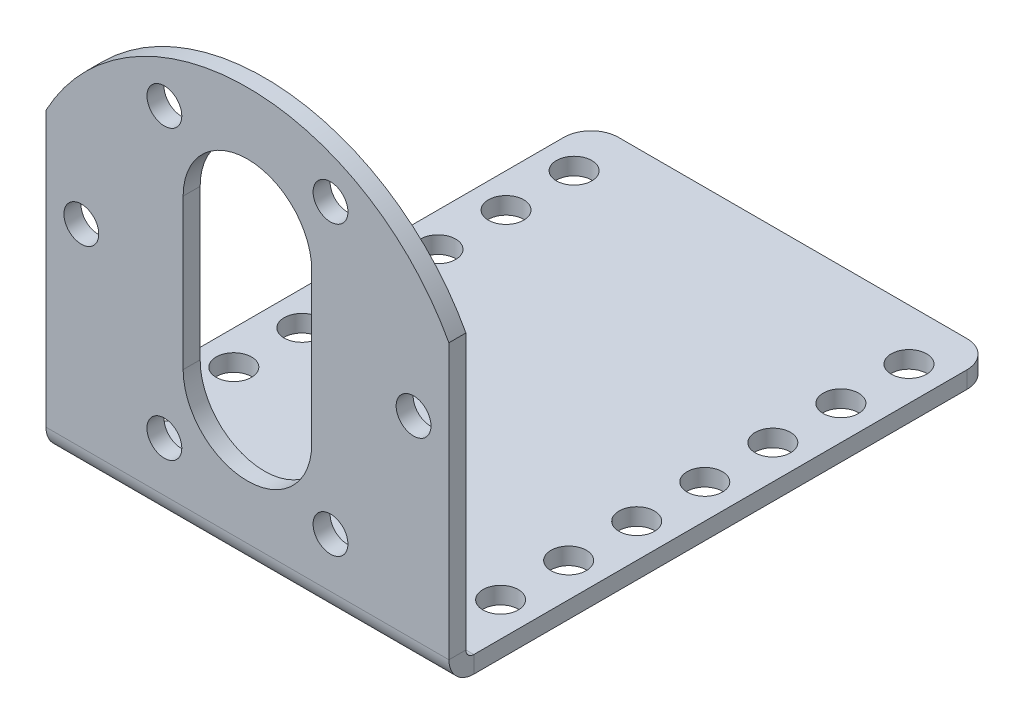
ISO-10303-21;
HEADER;
FILE_DESCRIPTION(('STEP AP214'),'2;1');
FILE_NAME('part.step','',(''),(''),'','','');
FILE_SCHEMA(('AUTOMOTIVE_DESIGN { 1 0 10303 214 1 1 1 1 }'));
ENDSEC;
DATA;
#1=APPLICATION_CONTEXT('core data for automotive mechanical design processes');
#2=APPLICATION_PROTOCOL_DEFINITION('international standard','automotive_design',2000,#1);
#3=PRODUCT_CONTEXT('',#1,'mechanical');
#4=PRODUCT('Part','Part','',(#3));
#5=PRODUCT_RELATED_PRODUCT_CATEGORY('part','',(#4));
#6=PRODUCT_DEFINITION_FORMATION('','',#4);
#7=PRODUCT_DEFINITION_CONTEXT('part definition',#1,'design');
#8=PRODUCT_DEFINITION('design','',#6,#7);
#9=PRODUCT_DEFINITION_SHAPE('','',#8);
#10=(LENGTH_UNIT() NAMED_UNIT(*) SI_UNIT(.MILLI.,.METRE.));
#11=(NAMED_UNIT(*) PLANE_ANGLE_UNIT() SI_UNIT($,.RADIAN.));
#12=(NAMED_UNIT(*) SI_UNIT($,.STERADIAN.) SOLID_ANGLE_UNIT());
#13=UNCERTAINTY_MEASURE_WITH_UNIT(LENGTH_MEASURE(1.E-05),#10,'distance_accuracy_value','');
#14=(GEOMETRIC_REPRESENTATION_CONTEXT(3) GLOBAL_UNCERTAINTY_ASSIGNED_CONTEXT((#13)) GLOBAL_UNIT_ASSIGNED_CONTEXT((#10,
#11,#12)) REPRESENTATION_CONTEXT('',''));
#15=CARTESIAN_POINT('',(0.,0.,0.));
#16=DIRECTION('',(0.,0.,1.));
#17=DIRECTION('',(1.,0.,0.));
#18=AXIS2_PLACEMENT_3D('',#15,#16,#17);
#19=CARTESIAN_POINT('',(0.,0.,1.5875));
#20=DIRECTION('',(0.,0.,1.));
#21=DIRECTION('',(0.,-1.,0.));
#22=AXIS2_PLACEMENT_3D('',#19,#20,#21);
#23=PLANE('',#22);
#24=CARTESIAN_POINT('',(18.796,11.786,1.5875));
#25=DIRECTION('',(0.,0.,1.));
#26=DIRECTION('',(1.,0.,0.));
#27=AXIS2_PLACEMENT_3D('',#24,#25,#26);
#28=CIRCLE('',#27,6.);
#29=CARTESIAN_POINT('',(12.796,11.786,1.5875));
#30=VERTEX_POINT('',#29);
#31=CARTESIAN_POINT('',(24.796,11.786,1.58750000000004));
#32=VERTEX_POINT('',#31);
#33=EDGE_CURVE('E345',#30,#32,#28,.T.);
#34=ORIENTED_EDGE('',*,*,#33,.F.);
#35=DIRECTION('',(0.,-1.,0.));
#36=VECTOR('',#35,1.);
#37=CARTESIAN_POINT('',(12.796,11.786,1.5875));
#38=LINE('',#37,#36);
#39=CARTESIAN_POINT('',(12.796,25.806,1.5875));
#40=VERTEX_POINT('',#39);
#41=EDGE_CURVE('E332',#40,#30,#38,.T.);
#42=ORIENTED_EDGE('',*,*,#41,.F.);
#43=CARTESIAN_POINT('',(18.796,25.806,1.5875));
#44=DIRECTION('',(0.,0.,1.));
#45=DIRECTION('',(1.,0.,0.));
#46=AXIS2_PLACEMENT_3D('',#43,#44,#45);
#47=CIRCLE('',#46,6.);
#48=CARTESIAN_POINT('',(24.796,25.806,1.5875));
#49=VERTEX_POINT('',#48);
#50=EDGE_CURVE('E339',#49,#40,#47,.T.);
#51=ORIENTED_EDGE('',*,*,#50,.F.);
#52=DIRECTION('',(0.,1.,0.));
#53=VECTOR('',#52,1.);
#54=CARTESIAN_POINT('',(24.796,11.786,1.5875));
#55=LINE('',#54,#53);
#56=EDGE_CURVE('E342',#32,#49,#55,.T.);
#57=ORIENTED_EDGE('',*,*,#56,.F.);
#58=EDGE_LOOP('',(#34,#42,#51,#57));
#59=FACE_BOUND('',#58,.T.);
#60=CARTESIAN_POINT('',(11.0459999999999,5.37260624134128,1.5875));
#61=DIRECTION('',(0.,0.,1.));
#62=DIRECTION('',(1.,0.,0.));
#63=AXIS2_PLACEMENT_3D('',#60,#61,#62);
#64=CIRCLE('',#63,1.625);
#65=CARTESIAN_POINT('',(12.6709999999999,5.37260624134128,1.5875));
#66=VERTEX_POINT('',#65);
#67=EDGE_CURVE('E321',#66,#66,#64,.T.);
#68=ORIENTED_EDGE('',*,*,#67,.F.);
#69=EDGE_LOOP('',(#68));
#70=FACE_BOUND('',#69,.T.);
#71=CARTESIAN_POINT('',(26.5459999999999,5.37260624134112,1.5875));
#72=DIRECTION('',(0.,0.,1.));
#73=DIRECTION('',(1.,0.,0.));
#74=AXIS2_PLACEMENT_3D('',#71,#72,#73);
#75=CIRCLE('',#74,1.625);
#76=CARTESIAN_POINT('',(28.1709999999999,5.37260624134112,1.5875));
#77=VERTEX_POINT('',#76);
#78=EDGE_CURVE('E315',#77,#77,#75,.T.);
#79=ORIENTED_EDGE('',*,*,#78,.F.);
#80=EDGE_LOOP('',(#79));
#81=FACE_BOUND('',#80,.T.);
#82=CARTESIAN_POINT('',(34.296,18.7959999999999,1.5875));
#83=DIRECTION('',(0.,0.,1.));
#84=DIRECTION('',(1.,0.,0.));
#85=AXIS2_PLACEMENT_3D('',#82,#83,#84);
#86=CIRCLE('',#85,1.625);
#87=CARTESIAN_POINT('',(35.921,18.7959999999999,1.5875));
#88=VERTEX_POINT('',#87);
#89=EDGE_CURVE('E309',#88,#88,#86,.T.);
#90=ORIENTED_EDGE('',*,*,#89,.F.);
#91=EDGE_LOOP('',(#90));
#92=FACE_BOUND('',#91,.T.);
#93=CARTESIAN_POINT('',(26.5460000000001,32.2193937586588,1.5875));
#94=DIRECTION('',(0.,0.,1.));
#95=DIRECTION('',(1.,0.,0.));
#96=AXIS2_PLACEMENT_3D('',#93,#94,#95);
#97=CIRCLE('',#96,1.625);
#98=CARTESIAN_POINT('',(28.1710000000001,32.2193937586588,1.5875));
#99=VERTEX_POINT('',#98);
#100=EDGE_CURVE('E303',#99,#99,#97,.T.);
#101=ORIENTED_EDGE('',*,*,#100,.F.);
#102=EDGE_LOOP('',(#101));
#103=FACE_BOUND('',#102,.T.);
#104=CARTESIAN_POINT('',(11.046,32.2193937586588,1.5875));
#105=DIRECTION('',(0.,0.,1.));
#106=DIRECTION('',(1.,0.,0.));
#107=AXIS2_PLACEMENT_3D('',#104,#105,#106);
#108=CIRCLE('',#107,1.625);
#109=CARTESIAN_POINT('',(12.671,32.2193937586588,1.5875));
#110=VERTEX_POINT('',#109);
#111=EDGE_CURVE('E297',#110,#110,#108,.T.);
#112=ORIENTED_EDGE('',*,*,#111,.F.);
#113=EDGE_LOOP('',(#112));
#114=FACE_BOUND('',#113,.T.);
#115=CARTESIAN_POINT('',(3.296,18.796,1.5875));
#116=DIRECTION('',(0.,0.,1.));
#117=DIRECTION('',(1.,0.,0.));
#118=AXIS2_PLACEMENT_3D('',#115,#116,#117);
#119=CIRCLE('',#118,1.625);
#120=CARTESIAN_POINT('',(4.921,18.796,1.5875));
#121=VERTEX_POINT('',#120);
#122=EDGE_CURVE('E288',#121,#121,#119,.T.);
#123=ORIENTED_EDGE('',*,*,#122,.F.);
#124=EDGE_LOOP('',(#123));
#125=FACE_BOUND('',#124,.T.);
#126=CARTESIAN_POINT('',(18.796,16.256,1.58750000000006));
#127=DIRECTION('',(0.,0.,1.));
#128=DIRECTION('',(0.,-1.,0.));
#129=AXIS2_PLACEMENT_3D('',#126,#127,#128);
#130=CIRCLE('',#129,21.336);
#131=CARTESIAN_POINT('',(37.592,26.3523003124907,1.58750000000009));
#132=VERTEX_POINT('',#131);
#133=CARTESIAN_POINT('',(0.,26.3523003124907,1.58750000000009));
#134=VERTEX_POINT('',#133);
#135=EDGE_CURVE('E171',#132,#134,#130,.T.);
#136=ORIENTED_EDGE('',*,*,#135,.T.);
#137=DIRECTION('',(0.,1.,0.));
#138=VECTOR('',#137,1.);
#139=CARTESIAN_POINT('',(0.,37.592,1.58750000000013));
#140=LINE('',#139,#138);
#141=CARTESIAN_POINT('',(0.,0.736599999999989,1.5875));
#142=VERTEX_POINT('',#141);
#143=EDGE_CURVE('E179',#142,#134,#140,.T.);
#144=ORIENTED_EDGE('',*,*,#143,.F.);
#145=DIRECTION('',(1.,0.,0.));
#146=VECTOR('',#145,1.);
#147=CARTESIAN_POINT('',(0.,0.736599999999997,1.5875));
#148=LINE('',#147,#146);
#149=CARTESIAN_POINT('',(37.592,0.736599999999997,1.5875));
#150=VERTEX_POINT('',#149);
#151=EDGE_CURVE('E187',#142,#150,#148,.T.);
#152=ORIENTED_EDGE('',*,*,#151,.T.);
#153=DIRECTION('',(0.,-1.,0.));
#154=VECTOR('',#153,1.);
#155=CARTESIAN_POINT('',(37.592,0.,1.5875));
#156=LINE('',#155,#154);
#157=EDGE_CURVE('E194',#132,#150,#156,.T.);
#158=ORIENTED_EDGE('',*,*,#157,.F.);
#159=EDGE_LOOP('',(#136,#144,#152,#158));
#160=FACE_BOUND('',#159,.T.);
#161=ADVANCED_FACE('F57',(#59,#70,#81,#92,#103,#114,#125,#160),#23,.T.);
#162=CARTESIAN_POINT('',(0.,0.,0.));
#163=DIRECTION('',(0.,0.,1.));
#164=DIRECTION('',(0.,-1.,0.));
#165=AXIS2_PLACEMENT_3D('',#162,#163,#164);
#166=PLANE('',#165);
#167=DIRECTION('',(0.,1.,0.));
#168=VECTOR('',#167,1.);
#169=CARTESIAN_POINT('',(12.796,11.7859999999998,0.));
#170=LINE('',#169,#168);
#171=CARTESIAN_POINT('',(12.796,11.786,0.));
#172=VERTEX_POINT('',#171);
#173=CARTESIAN_POINT('',(12.796,25.806,0.));
#174=VERTEX_POINT('',#173);
#175=EDGE_CURVE('E350',#172,#174,#170,.T.);
#176=ORIENTED_EDGE('',*,*,#175,.F.);
#177=CARTESIAN_POINT('',(18.796,11.786,0.));
#178=DIRECTION('',(0.,0.,1.));
#179=DIRECTION('',(0.,-1.,0.));
#180=AXIS2_PLACEMENT_3D('',#177,#178,#179);
#181=CIRCLE('',#180,6.);
#182=CARTESIAN_POINT('',(24.796,11.786,0.));
#183=VERTEX_POINT('',#182);
#184=EDGE_CURVE('E347',#183,#172,#181,.F.);
#185=ORIENTED_EDGE('',*,*,#184,.F.);
#186=DIRECTION('',(0.,-1.,0.));
#187=VECTOR('',#186,1.);
#188=CARTESIAN_POINT('',(24.796,11.7859999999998,0.));
#189=LINE('',#188,#187);
#190=CARTESIAN_POINT('',(24.796,25.806,0.));
#191=VERTEX_POINT('',#190);
#192=EDGE_CURVE('E324',#191,#183,#189,.T.);
#193=ORIENTED_EDGE('',*,*,#192,.F.);
#194=CARTESIAN_POINT('',(18.796,25.806,0.));
#195=DIRECTION('',(0.,0.,1.));
#196=DIRECTION('',(0.,-1.,0.));
#197=AXIS2_PLACEMENT_3D('',#194,#195,#196);
#198=CIRCLE('',#197,6.);
#199=EDGE_CURVE('E353',#174,#191,#198,.F.);
#200=ORIENTED_EDGE('',*,*,#199,.F.);
#201=EDGE_LOOP('',(#176,#185,#193,#200));
#202=FACE_BOUND('',#201,.T.);
#203=CARTESIAN_POINT('',(11.0459999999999,5.37260624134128,0.));
#204=DIRECTION('',(0.,0.,1.));
#205=DIRECTION('',(0.,-1.,0.));
#206=AXIS2_PLACEMENT_3D('',#203,#204,#205);
#207=CIRCLE('',#206,1.625);
#208=CARTESIAN_POINT('',(11.0459999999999,3.74760624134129,0.));
#209=VERTEX_POINT('',#208);
#210=EDGE_CURVE('E318',#209,#209,#207,.F.);
#211=ORIENTED_EDGE('',*,*,#210,.F.);
#212=EDGE_LOOP('',(#211));
#213=FACE_BOUND('',#212,.T.);
#214=CARTESIAN_POINT('',(26.5459999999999,5.37260624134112,0.));
#215=DIRECTION('',(0.,0.,1.));
#216=DIRECTION('',(0.,-1.,0.));
#217=AXIS2_PLACEMENT_3D('',#214,#215,#216);
#218=CIRCLE('',#217,1.625);
#219=CARTESIAN_POINT('',(26.5459999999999,3.74760624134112,0.));
#220=VERTEX_POINT('',#219);
#221=EDGE_CURVE('E312',#220,#220,#218,.F.);
#222=ORIENTED_EDGE('',*,*,#221,.F.);
#223=EDGE_LOOP('',(#222));
#224=FACE_BOUND('',#223,.T.);
#225=CARTESIAN_POINT('',(34.296,18.7959999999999,0.));
#226=DIRECTION('',(0.,0.,1.));
#227=DIRECTION('',(0.,-1.,0.));
#228=AXIS2_PLACEMENT_3D('',#225,#226,#227);
#229=CIRCLE('',#228,1.625);
#230=CARTESIAN_POINT('',(34.296,17.1709999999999,0.));
#231=VERTEX_POINT('',#230);
#232=EDGE_CURVE('E306',#231,#231,#229,.F.);
#233=ORIENTED_EDGE('',*,*,#232,.F.);
#234=EDGE_LOOP('',(#233));
#235=FACE_BOUND('',#234,.T.);
#236=CARTESIAN_POINT('',(26.5460000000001,32.2193937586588,1.11022302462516E-13));
#237=DIRECTION('',(0.,0.,1.));
#238=DIRECTION('',(0.,-1.,0.));
#239=AXIS2_PLACEMENT_3D('',#236,#237,#238);
#240=CIRCLE('',#239,1.625);
#241=CARTESIAN_POINT('',(26.5460000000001,30.5943937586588,1.05348645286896E-13));
#242=VERTEX_POINT('',#241);
#243=EDGE_CURVE('E300',#242,#242,#240,.F.);
#244=ORIENTED_EDGE('',*,*,#243,.F.);
#245=EDGE_LOOP('',(#244));
#246=FACE_BOUND('',#245,.T.);
#247=CARTESIAN_POINT('',(11.046,32.2193937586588,1.11022302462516E-13));
#248=DIRECTION('',(0.,0.,1.));
#249=DIRECTION('',(0.,-1.,0.));
#250=AXIS2_PLACEMENT_3D('',#247,#248,#249);
#251=CIRCLE('',#250,1.625);
#252=CARTESIAN_POINT('',(11.046,30.5943937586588,1.05348645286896E-13));
#253=VERTEX_POINT('',#252);
#254=EDGE_CURVE('E292',#253,#253,#251,.F.);
#255=ORIENTED_EDGE('',*,*,#254,.F.);
#256=EDGE_LOOP('',(#255));
#257=FACE_BOUND('',#256,.T.);
#258=CARTESIAN_POINT('',(3.296,18.796,0.));
#259=DIRECTION('',(0.,0.,1.));
#260=DIRECTION('',(0.,-1.,0.));
#261=AXIS2_PLACEMENT_3D('',#258,#259,#260);
#262=CIRCLE('',#261,1.625);
#263=CARTESIAN_POINT('',(3.296,17.171,0.));
#264=VERTEX_POINT('',#263);
#265=EDGE_CURVE('E286',#264,#264,#262,.F.);
#266=ORIENTED_EDGE('',*,*,#265,.F.);
#267=EDGE_LOOP('',(#266));
#268=FACE_BOUND('',#267,.T.);
#269=DIRECTION('',(0.,1.,0.));
#270=VECTOR('',#269,1.);
#271=CARTESIAN_POINT('',(0.,37.592,1.31251766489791E-13));
#272=LINE('',#271,#270);
#273=CARTESIAN_POINT('',(0.,0.736599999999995,0.));
#274=VERTEX_POINT('',#273);
#275=CARTESIAN_POINT('',(0.,26.3523003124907,1.11672823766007E-13));
#276=VERTEX_POINT('',#275);
#277=EDGE_CURVE('E177',#274,#276,#272,.T.);
#278=ORIENTED_EDGE('',*,*,#277,.T.);
#279=CARTESIAN_POINT('',(18.796,16.256,0.));
#280=DIRECTION('',(0.,0.,1.));
#281=DIRECTION('',(0.,-1.,0.));
#282=AXIS2_PLACEMENT_3D('',#279,#280,#281);
#283=CIRCLE('',#282,21.336);
#284=CARTESIAN_POINT('',(37.592,26.3523003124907,0.));
#285=VERTEX_POINT('',#284);
#286=EDGE_CURVE('E161',#285,#276,#283,.T.);
#287=ORIENTED_EDGE('',*,*,#286,.F.);
#288=DIRECTION('',(0.,-1.,0.));
#289=VECTOR('',#288,1.);
#290=CARTESIAN_POINT('',(37.592,0.,0.));
#291=LINE('',#290,#289);
#292=CARTESIAN_POINT('',(37.592,0.736599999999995,0.));
#293=VERTEX_POINT('',#292);
#294=EDGE_CURVE('E186',#285,#293,#291,.T.);
#295=ORIENTED_EDGE('',*,*,#294,.T.);
#296=DIRECTION('',(1.,0.,0.));
#297=VECTOR('',#296,1.);
#298=CARTESIAN_POINT('',(0.,0.736599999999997,0.));
#299=LINE('',#298,#297);
#300=EDGE_CURVE('E185',#274,#293,#299,.T.);
#301=ORIENTED_EDGE('',*,*,#300,.F.);
#302=EDGE_LOOP('',(#278,#287,#295,#301));
#303=FACE_BOUND('',#302,.T.);
#304=ADVANCED_FACE('F183',(#202,#213,#224,#235,#246,#257,#268,#303),#166,.F.);
#305=CARTESIAN_POINT('',(0.,37.592,1.58750000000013));
#306=DIRECTION('',(-1.,0.,0.));
#307=DIRECTION('',(0.,0.,1.));
#308=AXIS2_PLACEMENT_3D('',#305,#306,#307);
#309=PLANE('',#308);
#310=ORIENTED_EDGE('',*,*,#143,.T.);
#311=DIRECTION('',(0.,0.,-1.));
#312=VECTOR('',#311,1.);
#313=CARTESIAN_POINT('',(0.,26.3523003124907,1.11672823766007E-13));
#314=LINE('',#313,#312);
#315=EDGE_CURVE('E164',#276,#134,#314,.F.);
#316=ORIENTED_EDGE('',*,*,#315,.F.);
#317=ORIENTED_EDGE('',*,*,#277,.F.);
#318=DIRECTION('',(0.,0.,1.));
#319=VECTOR('',#318,1.);
#320=CARTESIAN_POINT('',(0.,0.736599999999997,0.));
#321=LINE('',#320,#319);
#322=EDGE_CURVE('E282',#274,#142,#321,.T.);
#323=ORIENTED_EDGE('',*,*,#322,.T.);
#324=EDGE_LOOP('',(#310,#316,#317,#323));
#325=FACE_BOUND('',#324,.T.);
#326=ADVANCED_FACE('F175',(#325),#309,.T.);
#327=CARTESIAN_POINT('',(37.592,0.,1.5875));
#328=DIRECTION('',(1.,0.,0.));
#329=DIRECTION('',(0.,0.,-1.));
#330=AXIS2_PLACEMENT_3D('',#327,#328,#329);
#331=PLANE('',#330);
#332=ORIENTED_EDGE('',*,*,#294,.F.);
#333=DIRECTION('',(0.,0.,-1.));
#334=VECTOR('',#333,1.);
#335=CARTESIAN_POINT('',(37.592,26.3523003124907,0.));
#336=LINE('',#335,#334);
#337=EDGE_CURVE('E167',#285,#132,#336,.F.);
#338=ORIENTED_EDGE('',*,*,#337,.T.);
#339=ORIENTED_EDGE('',*,*,#157,.T.);
#340=DIRECTION('',(0.,0.,1.));
#341=VECTOR('',#340,1.);
#342=CARTESIAN_POINT('',(37.592,0.736599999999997,0.));
#343=LINE('',#342,#341);
#344=EDGE_CURVE('E191',#293,#150,#343,.T.);
#345=ORIENTED_EDGE('',*,*,#344,.F.);
#346=EDGE_LOOP('',(#332,#338,#339,#345));
#347=FACE_BOUND('',#346,.T.);
#348=ADVANCED_FACE('F279',(#347),#331,.T.);
#349=CARTESIAN_POINT('',(37.592,-1.5875,0.));
#350=DIRECTION('',(1.,0.,0.));
#351=DIRECTION('',(0.,0.,-1.));
#352=AXIS2_PLACEMENT_3D('',#349,#350,#351);
#353=PLANE('',#352);
#354=DIRECTION('',(0.,0.,-1.));
#355=VECTOR('',#354,1.);
#356=CARTESIAN_POINT('',(37.592,-1.5875,0.));
#357=LINE('',#356,#355);
#358=CARTESIAN_POINT('',(37.592,-1.5875,-0.7366));
#359=VERTEX_POINT('',#358);
#360=CARTESIAN_POINT('',(37.592,-1.5875,-46.736));
#361=VERTEX_POINT('',#360);
#362=EDGE_CURVE('E224',#359,#361,#357,.T.);
#363=ORIENTED_EDGE('',*,*,#362,.T.);
#364=DIRECTION('',(0.,1.,0.));
#365=VECTOR('',#364,1.);
#366=CARTESIAN_POINT('',(37.592,-1.5875,-46.736));
#367=LINE('',#366,#365);
#368=CARTESIAN_POINT('',(37.592,0.,-46.736));
#369=VERTEX_POINT('',#368);
#370=EDGE_CURVE('E12',#361,#369,#367,.T.);
#371=ORIENTED_EDGE('',*,*,#370,.T.);
#372=DIRECTION('',(0.,0.,-1.));
#373=VECTOR('',#372,1.);
#374=CARTESIAN_POINT('',(37.592,0.,0.));
#375=LINE('',#374,#373);
#376=CARTESIAN_POINT('',(37.592,0.,-0.736599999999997));
#377=VERTEX_POINT('',#376);
#378=EDGE_CURVE('E232',#377,#369,#375,.T.);
#379=ORIENTED_EDGE('',*,*,#378,.F.);
#380=DIRECTION('',(0.,-1.,0.));
#381=VECTOR('',#380,1.);
#382=CARTESIAN_POINT('',(37.592,0.,-0.736599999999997));
#383=LINE('',#382,#381);
#384=EDGE_CURVE('E204',#377,#359,#383,.T.);
#385=ORIENTED_EDGE('',*,*,#384,.T.);
#386=EDGE_LOOP('',(#363,#371,#379,#385));
#387=FACE_BOUND('',#386,.T.);
#388=ADVANCED_FACE('F274',(#387),#353,.T.);
#389=CARTESIAN_POINT('',(0.,-1.5875,0.));
#390=DIRECTION('',(0.,-1.,0.));
#391=DIRECTION('',(0.,0.,-1.));
#392=AXIS2_PLACEMENT_3D('',#389,#390,#391);
#393=PLANE('',#392);
#394=CARTESIAN_POINT('',(34.417,-1.5875,-44.5135));
#395=DIRECTION('',(0.,1.,0.));
#396=DIRECTION('',(0.,0.,1.));
#397=AXIS2_PLACEMENT_3D('',#394,#395,#396);
#398=CIRCLE('',#397,1.651);
#399=CARTESIAN_POINT('',(34.417,-1.5875,-42.8625));
#400=VERTEX_POINT('',#399);
#401=EDGE_CURVE('E432',#400,#400,#398,.T.);
#402=ORIENTED_EDGE('',*,*,#401,.T.);
#403=EDGE_LOOP('',(#402));
#404=FACE_BOUND('',#403,.T.);
#405=CARTESIAN_POINT('',(34.417,-1.5875,-6.41350000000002));
#406=DIRECTION('',(0.,1.,0.));
#407=DIRECTION('',(0.,0.,1.));
#408=AXIS2_PLACEMENT_3D('',#405,#406,#407);
#409=CIRCLE('',#408,1.651);
#410=CARTESIAN_POINT('',(34.417,-1.5875,-4.76250000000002));
#411=VERTEX_POINT('',#410);
#412=EDGE_CURVE('E426',#411,#411,#409,.T.);
#413=ORIENTED_EDGE('',*,*,#412,.T.);
#414=EDGE_LOOP('',(#413));
#415=FACE_BOUND('',#414,.T.);
#416=CARTESIAN_POINT('',(34.417,-1.5875,-12.7635));
#417=DIRECTION('',(0.,1.,0.));
#418=DIRECTION('',(0.,0.,1.));
#419=AXIS2_PLACEMENT_3D('',#416,#417,#418);
#420=CIRCLE('',#419,1.651);
#421=CARTESIAN_POINT('',(34.417,-1.5875,-11.1125));
#422=VERTEX_POINT('',#421);
#423=EDGE_CURVE('E420',#422,#422,#420,.T.);
#424=ORIENTED_EDGE('',*,*,#423,.T.);
#425=EDGE_LOOP('',(#424));
#426=FACE_BOUND('',#425,.T.);
#427=CARTESIAN_POINT('',(34.417,-1.5875,-19.1135));
#428=DIRECTION('',(0.,1.,0.));
#429=DIRECTION('',(0.,0.,1.));
#430=AXIS2_PLACEMENT_3D('',#427,#428,#429);
#431=CIRCLE('',#430,1.651);
#432=CARTESIAN_POINT('',(34.417,-1.5875,-17.4625));
#433=VERTEX_POINT('',#432);
#434=EDGE_CURVE('E414',#433,#433,#431,.T.);
#435=ORIENTED_EDGE('',*,*,#434,.T.);
#436=EDGE_LOOP('',(#435));
#437=FACE_BOUND('',#436,.T.);
#438=CARTESIAN_POINT('',(34.417,-1.5875,-25.4635));
#439=DIRECTION('',(0.,1.,0.));
#440=DIRECTION('',(0.,0.,1.));
#441=AXIS2_PLACEMENT_3D('',#438,#439,#440);
#442=CIRCLE('',#441,1.651);
#443=CARTESIAN_POINT('',(34.417,-1.5875,-23.8125));
#444=VERTEX_POINT('',#443);
#445=EDGE_CURVE('E408',#444,#444,#442,.T.);
#446=ORIENTED_EDGE('',*,*,#445,.T.);
#447=EDGE_LOOP('',(#446));
#448=FACE_BOUND('',#447,.T.);
#449=CARTESIAN_POINT('',(34.417,-1.5875,-31.8135));
#450=DIRECTION('',(0.,1.,0.));
#451=DIRECTION('',(0.,0.,1.));
#452=AXIS2_PLACEMENT_3D('',#449,#450,#451);
#453=CIRCLE('',#452,1.651);
#454=CARTESIAN_POINT('',(34.417,-1.5875,-30.1625));
#455=VERTEX_POINT('',#454);
#456=EDGE_CURVE('E402',#455,#455,#453,.T.);
#457=ORIENTED_EDGE('',*,*,#456,.T.);
#458=EDGE_LOOP('',(#457));
#459=FACE_BOUND('',#458,.T.);
#460=CARTESIAN_POINT('',(34.417,-1.5875,-38.1635));
#461=DIRECTION('',(0.,1.,0.));
#462=DIRECTION('',(0.,0.,1.));
#463=AXIS2_PLACEMENT_3D('',#460,#461,#462);
#464=CIRCLE('',#463,1.651);
#465=CARTESIAN_POINT('',(34.417,-1.5875,-36.5125));
#466=VERTEX_POINT('',#465);
#467=EDGE_CURVE('E396',#466,#466,#464,.T.);
#468=ORIENTED_EDGE('',*,*,#467,.T.);
#469=EDGE_LOOP('',(#468));
#470=FACE_BOUND('',#469,.T.);
#471=CARTESIAN_POINT('',(3.175,-1.5875,-6.41350000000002));
#472=DIRECTION('',(0.,1.,0.));
#473=DIRECTION('',(0.,0.,1.));
#474=AXIS2_PLACEMENT_3D('',#471,#472,#473);
#475=CIRCLE('',#474,1.651);
#476=CARTESIAN_POINT('',(3.175,-1.5875,-4.76250000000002));
#477=VERTEX_POINT('',#476);
#478=EDGE_CURVE('E390',#477,#477,#475,.T.);
#479=ORIENTED_EDGE('',*,*,#478,.T.);
#480=EDGE_LOOP('',(#479));
#481=FACE_BOUND('',#480,.T.);
#482=CARTESIAN_POINT('',(3.175,-1.5875,-12.7635));
#483=DIRECTION('',(0.,1.,0.));
#484=DIRECTION('',(0.,0.,1.));
#485=AXIS2_PLACEMENT_3D('',#482,#483,#484);
#486=CIRCLE('',#485,1.651);
#487=CARTESIAN_POINT('',(3.175,-1.5875,-11.1125));
#488=VERTEX_POINT('',#487);
#489=EDGE_CURVE('E384',#488,#488,#486,.T.);
#490=ORIENTED_EDGE('',*,*,#489,.T.);
#491=EDGE_LOOP('',(#490));
#492=FACE_BOUND('',#491,.T.);
#493=CARTESIAN_POINT('',(3.175,-1.5875,-19.1135));
#494=DIRECTION('',(0.,1.,0.));
#495=DIRECTION('',(0.,0.,1.));
#496=AXIS2_PLACEMENT_3D('',#493,#494,#495);
#497=CIRCLE('',#496,1.651);
#498=CARTESIAN_POINT('',(3.175,-1.5875,-17.4625));
#499=VERTEX_POINT('',#498);
#500=EDGE_CURVE('E378',#499,#499,#497,.T.);
#501=ORIENTED_EDGE('',*,*,#500,.T.);
#502=EDGE_LOOP('',(#501));
#503=FACE_BOUND('',#502,.T.);
#504=CARTESIAN_POINT('',(3.175,-1.5875,-25.4635));
#505=DIRECTION('',(0.,1.,0.));
#506=DIRECTION('',(0.,0.,1.));
#507=AXIS2_PLACEMENT_3D('',#504,#505,#506);
#508=CIRCLE('',#507,1.651);
#509=CARTESIAN_POINT('',(3.175,-1.5875,-23.8125));
#510=VERTEX_POINT('',#509);
#511=EDGE_CURVE('E372',#510,#510,#508,.T.);
#512=ORIENTED_EDGE('',*,*,#511,.T.);
#513=EDGE_LOOP('',(#512));
#514=FACE_BOUND('',#513,.T.);
#515=CARTESIAN_POINT('',(3.175,-1.5875,-31.8135));
#516=DIRECTION('',(0.,1.,0.));
#517=DIRECTION('',(0.,0.,1.));
#518=AXIS2_PLACEMENT_3D('',#515,#516,#517);
#519=CIRCLE('',#518,1.651);
#520=CARTESIAN_POINT('',(3.175,-1.5875,-30.1625));
#521=VERTEX_POINT('',#520);
#522=EDGE_CURVE('E366',#521,#521,#519,.T.);
#523=ORIENTED_EDGE('',*,*,#522,.T.);
#524=EDGE_LOOP('',(#523));
#525=FACE_BOUND('',#524,.T.);
#526=CARTESIAN_POINT('',(3.175,-1.5875,-38.1635));
#527=DIRECTION('',(0.,1.,0.));
#528=DIRECTION('',(0.,0.,1.));
#529=AXIS2_PLACEMENT_3D('',#526,#527,#528);
#530=CIRCLE('',#529,1.651);
#531=CARTESIAN_POINT('',(3.175,-1.5875,-36.5125));
#532=VERTEX_POINT('',#531);
#533=EDGE_CURVE('E360',#532,#532,#530,.T.);
#534=ORIENTED_EDGE('',*,*,#533,.T.);
#535=EDGE_LOOP('',(#534));
#536=FACE_BOUND('',#535,.T.);
#537=CARTESIAN_POINT('',(3.175,-1.5875,-44.5135));
#538=DIRECTION('',(0.,1.,0.));
#539=DIRECTION('',(0.,0.,1.));
#540=AXIS2_PLACEMENT_3D('',#537,#538,#539);
#541=CIRCLE('',#540,1.651);
#542=CARTESIAN_POINT('',(3.175,-1.5875,-42.8625));
#543=VERTEX_POINT('',#542);
#544=EDGE_CURVE('E180',#543,#543,#541,.T.);
#545=ORIENTED_EDGE('',*,*,#544,.T.);
#546=EDGE_LOOP('',(#545));
#547=FACE_BOUND('',#546,.T.);
#548=DIRECTION('',(0.,0.,1.));
#549=VECTOR('',#548,1.);
#550=CARTESIAN_POINT('',(0.,-1.5875,0.));
#551=LINE('',#550,#549);
#552=CARTESIAN_POINT('',(0.,-1.5875,-46.736));
#553=VERTEX_POINT('',#552);
#554=CARTESIAN_POINT('',(0.,-1.5875,-0.7366));
#555=VERTEX_POINT('',#554);
#556=EDGE_CURVE('E222',#553,#555,#551,.T.);
#557=ORIENTED_EDGE('',*,*,#556,.F.);
#558=CARTESIAN_POINT('',(2.54,-1.5875,-46.736));
#559=DIRECTION('',(0.,-1.,0.));
#560=DIRECTION('',(0.,0.,-1.));
#561=AXIS2_PLACEMENT_3D('',#558,#559,#560);
#562=CIRCLE('',#561,2.54);
#563=CARTESIAN_POINT('',(2.54,-1.5875,-49.276));
#564=VERTEX_POINT('',#563);
#565=EDGE_CURVE('E65',#553,#564,#562,.T.);
#566=ORIENTED_EDGE('',*,*,#565,.T.);
#567=DIRECTION('',(-1.,0.,0.));
#568=VECTOR('',#567,1.);
#569=CARTESIAN_POINT('',(0.,-1.5875,-49.276));
#570=LINE('',#569,#568);
#571=CARTESIAN_POINT('',(35.052,-1.5875,-49.276));
#572=VERTEX_POINT('',#571);
#573=EDGE_CURVE('E227',#572,#564,#570,.T.);
#574=ORIENTED_EDGE('',*,*,#573,.F.);
#575=CARTESIAN_POINT('',(35.052,-1.5875,-46.736));
#576=DIRECTION('',(0.,-1.,0.));
#577=DIRECTION('',(0.,0.,-1.));
#578=AXIS2_PLACEMENT_3D('',#575,#576,#577);
#579=CIRCLE('',#578,2.54);
#580=EDGE_CURVE('E72',#572,#361,#579,.T.);
#581=ORIENTED_EDGE('',*,*,#580,.T.);
#582=ORIENTED_EDGE('',*,*,#362,.F.);
#583=DIRECTION('',(1.,0.,0.));
#584=VECTOR('',#583,1.);
#585=CARTESIAN_POINT('',(37.592,-1.5875,-0.7366));
#586=LINE('',#585,#584);
#587=EDGE_CURVE('E197',#359,#555,#586,.F.);
#588=ORIENTED_EDGE('',*,*,#587,.T.);
#589=EDGE_LOOP('',(#557,#566,#574,#581,#582,#588));
#590=FACE_BOUND('',#589,.T.);
#591=ADVANCED_FACE('F247',(#404,#415,#426,#437,#448,#459,#470,#481,#492,#503,#514,#525,#536,
#547,#590),#393,.T.);
#592=CARTESIAN_POINT('',(0.,0.,0.));
#593=DIRECTION('',(0.,-1.,0.));
#594=DIRECTION('',(0.,0.,-1.));
#595=AXIS2_PLACEMENT_3D('',#592,#593,#594);
#596=PLANE('',#595);
#597=CARTESIAN_POINT('',(34.417,0.,-44.5135));
#598=DIRECTION('',(0.,1.,0.));
#599=DIRECTION('',(0.,0.,1.));
#600=AXIS2_PLACEMENT_3D('',#597,#598,#599);
#601=CIRCLE('',#600,1.651);
#602=CARTESIAN_POINT('',(34.417,0.,-42.8625));
#603=VERTEX_POINT('',#602);
#604=EDGE_CURVE('E435',#603,#603,#601,.T.);
#605=ORIENTED_EDGE('',*,*,#604,.F.);
#606=EDGE_LOOP('',(#605));
#607=FACE_BOUND('',#606,.T.);
#608=CARTESIAN_POINT('',(34.417,0.,-6.41350000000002));
#609=DIRECTION('',(0.,1.,0.));
#610=DIRECTION('',(0.,0.,1.));
#611=AXIS2_PLACEMENT_3D('',#608,#609,#610);
#612=CIRCLE('',#611,1.651);
#613=CARTESIAN_POINT('',(34.417,0.,-4.76250000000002));
#614=VERTEX_POINT('',#613);
#615=EDGE_CURVE('E429',#614,#614,#612,.T.);
#616=ORIENTED_EDGE('',*,*,#615,.F.);
#617=EDGE_LOOP('',(#616));
#618=FACE_BOUND('',#617,.T.);
#619=CARTESIAN_POINT('',(34.417,0.,-12.7635));
#620=DIRECTION('',(0.,1.,0.));
#621=DIRECTION('',(0.,0.,1.));
#622=AXIS2_PLACEMENT_3D('',#619,#620,#621);
#623=CIRCLE('',#622,1.651);
#624=CARTESIAN_POINT('',(34.417,0.,-11.1125));
#625=VERTEX_POINT('',#624);
#626=EDGE_CURVE('E423',#625,#625,#623,.T.);
#627=ORIENTED_EDGE('',*,*,#626,.F.);
#628=EDGE_LOOP('',(#627));
#629=FACE_BOUND('',#628,.T.);
#630=CARTESIAN_POINT('',(34.417,0.,-19.1135));
#631=DIRECTION('',(0.,1.,0.));
#632=DIRECTION('',(0.,0.,1.));
#633=AXIS2_PLACEMENT_3D('',#630,#631,#632);
#634=CIRCLE('',#633,1.651);
#635=CARTESIAN_POINT('',(34.417,0.,-17.4625));
#636=VERTEX_POINT('',#635);
#637=EDGE_CURVE('E417',#636,#636,#634,.T.);
#638=ORIENTED_EDGE('',*,*,#637,.F.);
#639=EDGE_LOOP('',(#638));
#640=FACE_BOUND('',#639,.T.);
#641=CARTESIAN_POINT('',(34.417,0.,-25.4635));
#642=DIRECTION('',(0.,1.,0.));
#643=DIRECTION('',(0.,0.,1.));
#644=AXIS2_PLACEMENT_3D('',#641,#642,#643);
#645=CIRCLE('',#644,1.651);
#646=CARTESIAN_POINT('',(34.417,0.,-23.8125));
#647=VERTEX_POINT('',#646);
#648=EDGE_CURVE('E411',#647,#647,#645,.T.);
#649=ORIENTED_EDGE('',*,*,#648,.F.);
#650=EDGE_LOOP('',(#649));
#651=FACE_BOUND('',#650,.T.);
#652=CARTESIAN_POINT('',(34.417,0.,-31.8135));
#653=DIRECTION('',(0.,1.,0.));
#654=DIRECTION('',(0.,0.,1.));
#655=AXIS2_PLACEMENT_3D('',#652,#653,#654);
#656=CIRCLE('',#655,1.651);
#657=CARTESIAN_POINT('',(34.417,0.,-30.1625));
#658=VERTEX_POINT('',#657);
#659=EDGE_CURVE('E405',#658,#658,#656,.T.);
#660=ORIENTED_EDGE('',*,*,#659,.F.);
#661=EDGE_LOOP('',(#660));
#662=FACE_BOUND('',#661,.T.);
#663=CARTESIAN_POINT('',(34.417,0.,-38.1635));
#664=DIRECTION('',(0.,1.,0.));
#665=DIRECTION('',(0.,0.,1.));
#666=AXIS2_PLACEMENT_3D('',#663,#664,#665);
#667=CIRCLE('',#666,1.651);
#668=CARTESIAN_POINT('',(34.417,0.,-36.5125));
#669=VERTEX_POINT('',#668);
#670=EDGE_CURVE('E399',#669,#669,#667,.T.);
#671=ORIENTED_EDGE('',*,*,#670,.F.);
#672=EDGE_LOOP('',(#671));
#673=FACE_BOUND('',#672,.T.);
#674=CARTESIAN_POINT('',(3.175,0.,-6.41350000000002));
#675=DIRECTION('',(0.,1.,0.));
#676=DIRECTION('',(0.,0.,1.));
#677=AXIS2_PLACEMENT_3D('',#674,#675,#676);
#678=CIRCLE('',#677,1.651);
#679=CARTESIAN_POINT('',(3.175,0.,-4.76250000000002));
#680=VERTEX_POINT('',#679);
#681=EDGE_CURVE('E393',#680,#680,#678,.T.);
#682=ORIENTED_EDGE('',*,*,#681,.F.);
#683=EDGE_LOOP('',(#682));
#684=FACE_BOUND('',#683,.T.);
#685=CARTESIAN_POINT('',(3.175,0.,-12.7635));
#686=DIRECTION('',(0.,1.,0.));
#687=DIRECTION('',(0.,0.,1.));
#688=AXIS2_PLACEMENT_3D('',#685,#686,#687);
#689=CIRCLE('',#688,1.651);
#690=CARTESIAN_POINT('',(3.175,0.,-11.1125));
#691=VERTEX_POINT('',#690);
#692=EDGE_CURVE('E387',#691,#691,#689,.T.);
#693=ORIENTED_EDGE('',*,*,#692,.F.);
#694=EDGE_LOOP('',(#693));
#695=FACE_BOUND('',#694,.T.);
#696=CARTESIAN_POINT('',(3.175,0.,-19.1135));
#697=DIRECTION('',(0.,1.,0.));
#698=DIRECTION('',(0.,0.,1.));
#699=AXIS2_PLACEMENT_3D('',#696,#697,#698);
#700=CIRCLE('',#699,1.651);
#701=CARTESIAN_POINT('',(3.175,0.,-17.4625));
#702=VERTEX_POINT('',#701);
#703=EDGE_CURVE('E381',#702,#702,#700,.T.);
#704=ORIENTED_EDGE('',*,*,#703,.F.);
#705=EDGE_LOOP('',(#704));
#706=FACE_BOUND('',#705,.T.);
#707=CARTESIAN_POINT('',(3.175,0.,-25.4635));
#708=DIRECTION('',(0.,1.,0.));
#709=DIRECTION('',(0.,0.,1.));
#710=AXIS2_PLACEMENT_3D('',#707,#708,#709);
#711=CIRCLE('',#710,1.651);
#712=CARTESIAN_POINT('',(3.175,0.,-23.8125));
#713=VERTEX_POINT('',#712);
#714=EDGE_CURVE('E375',#713,#713,#711,.T.);
#715=ORIENTED_EDGE('',*,*,#714,.F.);
#716=EDGE_LOOP('',(#715));
#717=FACE_BOUND('',#716,.T.);
#718=CARTESIAN_POINT('',(3.175,0.,-31.8135));
#719=DIRECTION('',(0.,1.,0.));
#720=DIRECTION('',(0.,0.,1.));
#721=AXIS2_PLACEMENT_3D('',#718,#719,#720);
#722=CIRCLE('',#721,1.651);
#723=CARTESIAN_POINT('',(3.175,0.,-30.1625));
#724=VERTEX_POINT('',#723);
#725=EDGE_CURVE('E369',#724,#724,#722,.T.);
#726=ORIENTED_EDGE('',*,*,#725,.F.);
#727=EDGE_LOOP('',(#726));
#728=FACE_BOUND('',#727,.T.);
#729=CARTESIAN_POINT('',(3.175,0.,-38.1635));
#730=DIRECTION('',(0.,1.,0.));
#731=DIRECTION('',(0.,0.,1.));
#732=AXIS2_PLACEMENT_3D('',#729,#730,#731);
#733=CIRCLE('',#732,1.651);
#734=CARTESIAN_POINT('',(3.175,0.,-36.5125));
#735=VERTEX_POINT('',#734);
#736=EDGE_CURVE('E363',#735,#735,#733,.T.);
#737=ORIENTED_EDGE('',*,*,#736,.F.);
#738=EDGE_LOOP('',(#737));
#739=FACE_BOUND('',#738,.T.);
#740=CARTESIAN_POINT('',(3.175,0.,-44.5135));
#741=DIRECTION('',(0.,1.,0.));
#742=DIRECTION('',(0.,0.,1.));
#743=AXIS2_PLACEMENT_3D('',#740,#741,#742);
#744=CIRCLE('',#743,1.651);
#745=CARTESIAN_POINT('',(3.175,0.,-42.8625));
#746=VERTEX_POINT('',#745);
#747=EDGE_CURVE('E357',#746,#746,#744,.T.);
#748=ORIENTED_EDGE('',*,*,#747,.F.);
#749=EDGE_LOOP('',(#748));
#750=FACE_BOUND('',#749,.T.);
#751=DIRECTION('',(-1.,0.,0.));
#752=VECTOR('',#751,1.);
#753=CARTESIAN_POINT('',(0.,0.,-49.276));
#754=LINE('',#753,#752);
#755=CARTESIAN_POINT('',(35.052,0.,-49.276));
#756=VERTEX_POINT('',#755);
#757=CARTESIAN_POINT('',(2.54,0.,-49.276));
#758=VERTEX_POINT('',#757);
#759=EDGE_CURVE('E225',#756,#758,#754,.T.);
#760=ORIENTED_EDGE('',*,*,#759,.T.);
#761=CARTESIAN_POINT('',(2.54,0.,-46.736));
#762=DIRECTION('',(0.,-1.,0.));
#763=DIRECTION('',(0.,0.,-1.));
#764=AXIS2_PLACEMENT_3D('',#761,#762,#763);
#765=CIRCLE('',#764,2.54);
#766=CARTESIAN_POINT('',(0.,0.,-46.736));
#767=VERTEX_POINT('',#766);
#768=EDGE_CURVE('E243',#758,#767,#765,.F.);
#769=ORIENTED_EDGE('',*,*,#768,.T.);
#770=DIRECTION('',(0.,0.,1.));
#771=VECTOR('',#770,1.);
#772=CARTESIAN_POINT('',(0.,0.,0.));
#773=LINE('',#772,#771);
#774=CARTESIAN_POINT('',(0.,0.,-0.7366));
#775=VERTEX_POINT('',#774);
#776=EDGE_CURVE('E219',#767,#775,#773,.T.);
#777=ORIENTED_EDGE('',*,*,#776,.T.);
#778=DIRECTION('',(1.,0.,0.));
#779=VECTOR('',#778,1.);
#780=CARTESIAN_POINT('',(37.592,0.,-0.736599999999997));
#781=LINE('',#780,#779);
#782=EDGE_CURVE('E210',#377,#775,#781,.F.);
#783=ORIENTED_EDGE('',*,*,#782,.F.);
#784=ORIENTED_EDGE('',*,*,#378,.T.);
#785=CARTESIAN_POINT('',(35.052,0.,-46.736));
#786=DIRECTION('',(0.,-1.,0.));
#787=DIRECTION('',(0.,0.,-1.));
#788=AXIS2_PLACEMENT_3D('',#785,#786,#787);
#789=CIRCLE('',#788,2.54);
#790=EDGE_CURVE('E241',#369,#756,#789,.F.);
#791=ORIENTED_EDGE('',*,*,#790,.T.);
#792=EDGE_LOOP('',(#760,#769,#777,#783,#784,#791));
#793=FACE_BOUND('',#792,.T.);
#794=ADVANCED_FACE('F256',(#607,#618,#629,#640,#651,#662,#673,#684,#695,#706,#717,#728,#739,
#750,#793),#596,.F.);
#795=CARTESIAN_POINT('',(0.,-1.5875,0.));
#796=DIRECTION('',(-1.,0.,0.));
#797=DIRECTION('',(0.,0.,1.));
#798=AXIS2_PLACEMENT_3D('',#795,#796,#797);
#799=PLANE('',#798);
#800=ORIENTED_EDGE('',*,*,#776,.F.);
#801=DIRECTION('',(0.,1.,0.));
#802=VECTOR('',#801,1.);
#803=CARTESIAN_POINT('',(0.,-1.5875,-46.736));
#804=LINE('',#803,#802);
#805=EDGE_CURVE('E80',#767,#553,#804,.F.);
#806=ORIENTED_EDGE('',*,*,#805,.T.);
#807=ORIENTED_EDGE('',*,*,#556,.T.);
#808=DIRECTION('',(0.,-1.,0.));
#809=VECTOR('',#808,1.);
#810=CARTESIAN_POINT('',(0.,0.,-0.7366));
#811=LINE('',#810,#809);
#812=EDGE_CURVE('E216',#775,#555,#811,.T.);
#813=ORIENTED_EDGE('',*,*,#812,.F.);
#814=EDGE_LOOP('',(#800,#806,#807,#813));
#815=FACE_BOUND('',#814,.T.);
#816=ADVANCED_FACE('F259',(#815),#799,.T.);
#817=CARTESIAN_POINT('',(0.,-1.5875,-49.276));
#818=DIRECTION('',(0.,0.,-1.));
#819=DIRECTION('',(-1.,0.,0.));
#820=AXIS2_PLACEMENT_3D('',#817,#818,#819);
#821=PLANE('',#820);
#822=ORIENTED_EDGE('',*,*,#573,.T.);
#823=DIRECTION('',(0.,1.,0.));
#824=VECTOR('',#823,1.);
#825=CARTESIAN_POINT('',(2.54,-1.5875,-49.276));
#826=LINE('',#825,#824);
#827=EDGE_CURVE('E238',#564,#758,#826,.T.);
#828=ORIENTED_EDGE('',*,*,#827,.T.);
#829=ORIENTED_EDGE('',*,*,#759,.F.);
#830=DIRECTION('',(0.,1.,0.));
#831=VECTOR('',#830,1.);
#832=CARTESIAN_POINT('',(35.052,-1.5875,-49.276));
#833=LINE('',#832,#831);
#834=EDGE_CURVE('E230',#756,#572,#833,.F.);
#835=ORIENTED_EDGE('',*,*,#834,.T.);
#836=EDGE_LOOP('',(#822,#828,#829,#835));
#837=FACE_BOUND('',#836,.T.);
#838=ADVANCED_FACE('F251',(#837),#821,.T.);
#839=CARTESIAN_POINT('',(0.,0.736599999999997,-0.736599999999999));
#840=DIRECTION('',(-1.,0.,0.));
#841=DIRECTION('',(0.,0.,1.));
#842=AXIS2_PLACEMENT_3D('',#839,#840,#841);
#843=PLANE('',#842);
#844=ORIENTED_EDGE('',*,*,#322,.F.);
#845=CARTESIAN_POINT('',(0.,0.736599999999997,-0.736599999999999));
#846=DIRECTION('',(1.,0.,0.));
#847=DIRECTION('',(0.,0.,-1.));
#848=AXIS2_PLACEMENT_3D('',#845,#846,#847);
#849=CIRCLE('',#848,0.736600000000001);
#850=EDGE_CURVE('E207',#775,#274,#849,.F.);
#851=ORIENTED_EDGE('',*,*,#850,.F.);
#852=ORIENTED_EDGE('',*,*,#812,.T.);
#853=CARTESIAN_POINT('',(0.,0.736599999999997,-0.736599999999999));
#854=DIRECTION('',(1.,0.,0.));
#855=DIRECTION('',(0.,0.,-1.));
#856=AXIS2_PLACEMENT_3D('',#853,#854,#855);
#857=CIRCLE('',#856,2.3241);
#858=EDGE_CURVE('E200',#555,#142,#857,.F.);
#859=ORIENTED_EDGE('',*,*,#858,.T.);
#860=EDGE_LOOP('',(#844,#851,#852,#859));
#861=FACE_BOUND('',#860,.T.);
#862=ADVANCED_FACE('F263',(#861),#843,.T.);
#863=CARTESIAN_POINT('',(37.592,0.736599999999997,-0.736599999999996));
#864=DIRECTION('',(-1.,0.,0.));
#865=DIRECTION('',(0.,0.,1.));
#866=AXIS2_PLACEMENT_3D('',#863,#864,#865);
#867=PLANE('',#866);
#868=CARTESIAN_POINT('',(37.592,0.736599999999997,-0.736599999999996));
#869=DIRECTION('',(1.,0.,0.));
#870=DIRECTION('',(0.,0.,-1.));
#871=AXIS2_PLACEMENT_3D('',#868,#869,#870);
#872=CIRCLE('',#871,0.736600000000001);
#873=EDGE_CURVE('E213',#293,#377,#872,.T.);
#874=ORIENTED_EDGE('',*,*,#873,.F.);
#875=ORIENTED_EDGE('',*,*,#344,.T.);
#876=CARTESIAN_POINT('',(37.592,0.736599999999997,-0.736599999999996));
#877=DIRECTION('',(1.,0.,0.));
#878=DIRECTION('',(0.,0.,-1.));
#879=AXIS2_PLACEMENT_3D('',#876,#877,#878);
#880=CIRCLE('',#879,2.3241);
#881=EDGE_CURVE('E201',#150,#359,#880,.T.);
#882=ORIENTED_EDGE('',*,*,#881,.T.);
#883=ORIENTED_EDGE('',*,*,#384,.F.);
#884=EDGE_LOOP('',(#874,#875,#882,#883));
#885=FACE_BOUND('',#884,.T.);
#886=ADVANCED_FACE('F270',(#885),#867,.F.);
#887=CARTESIAN_POINT('',(37.592,0.736599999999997,-0.736599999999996));
#888=DIRECTION('',(1.,0.,0.));
#889=DIRECTION('',(0.,0.,1.));
#890=AXIS2_PLACEMENT_3D('',#887,#888,#889);
#891=CYLINDRICAL_SURFACE('',#890,2.3241);
#892=ORIENTED_EDGE('',*,*,#587,.F.);
#893=ORIENTED_EDGE('',*,*,#881,.F.);
#894=ORIENTED_EDGE('',*,*,#151,.F.);
#895=ORIENTED_EDGE('',*,*,#858,.F.);
#896=EDGE_LOOP('',(#892,#893,#894,#895));
#897=FACE_BOUND('',#896,.T.);
#898=ADVANCED_FACE('F266',(#897),#891,.T.);
#899=CARTESIAN_POINT('',(37.592,0.736599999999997,-0.736599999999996));
#900=DIRECTION('',(1.,0.,0.));
#901=DIRECTION('',(0.,0.,1.));
#902=AXIS2_PLACEMENT_3D('',#899,#900,#901);
#903=CYLINDRICAL_SURFACE('',#902,0.736600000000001);
#904=ORIENTED_EDGE('',*,*,#782,.T.);
#905=ORIENTED_EDGE('',*,*,#850,.T.);
#906=ORIENTED_EDGE('',*,*,#300,.T.);
#907=ORIENTED_EDGE('',*,*,#873,.T.);
#908=EDGE_LOOP('',(#904,#905,#906,#907));
#909=FACE_BOUND('',#908,.T.);
#910=ADVANCED_FACE('F277',(#909),#903,.F.);
#911=CARTESIAN_POINT('',(3.296,18.796,-49.277));
#912=DIRECTION('',(0.,0.,1.));
#913=DIRECTION('',(1.,0.,0.));
#914=AXIS2_PLACEMENT_3D('',#911,#912,#913);
#915=CYLINDRICAL_SURFACE('',#914,1.625);
#916=ORIENTED_EDGE('',*,*,#122,.T.);
#917=EDGE_LOOP('',(#916));
#918=FACE_BOUND('',#917,.T.);
#919=ORIENTED_EDGE('',*,*,#265,.T.);
#920=EDGE_LOOP('',(#919));
#921=FACE_BOUND('',#920,.T.);
#922=ADVANCED_FACE('F505',(#918,#921),#915,.F.);
#923=CARTESIAN_POINT('',(11.046,32.2193937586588,-49.277));
#924=DIRECTION('',(0.,0.,1.));
#925=DIRECTION('',(1.,0.,0.));
#926=AXIS2_PLACEMENT_3D('',#923,#924,#925);
#927=CYLINDRICAL_SURFACE('',#926,1.625);
#928=ORIENTED_EDGE('',*,*,#111,.T.);
#929=EDGE_LOOP('',(#928));
#930=FACE_BOUND('',#929,.T.);
#931=ORIENTED_EDGE('',*,*,#254,.T.);
#932=EDGE_LOOP('',(#931));
#933=FACE_BOUND('',#932,.T.);
#934=ADVANCED_FACE('F826',(#930,#933),#927,.F.);
#935=CARTESIAN_POINT('',(26.5460000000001,32.2193937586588,-49.277));
#936=DIRECTION('',(0.,0.,1.));
#937=DIRECTION('',(1.,0.,0.));
#938=AXIS2_PLACEMENT_3D('',#935,#936,#937);
#939=CYLINDRICAL_SURFACE('',#938,1.625);
#940=ORIENTED_EDGE('',*,*,#100,.T.);
#941=EDGE_LOOP('',(#940));
#942=FACE_BOUND('',#941,.T.);
#943=ORIENTED_EDGE('',*,*,#243,.T.);
#944=EDGE_LOOP('',(#943));
#945=FACE_BOUND('',#944,.T.);
#946=ADVANCED_FACE('F815',(#942,#945),#939,.F.);
#947=CARTESIAN_POINT('',(34.296,18.7959999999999,-49.277));
#948=DIRECTION('',(0.,0.,1.));
#949=DIRECTION('',(1.,0.,0.));
#950=AXIS2_PLACEMENT_3D('',#947,#948,#949);
#951=CYLINDRICAL_SURFACE('',#950,1.625);
#952=ORIENTED_EDGE('',*,*,#89,.T.);
#953=EDGE_LOOP('',(#952));
#954=FACE_BOUND('',#953,.T.);
#955=ORIENTED_EDGE('',*,*,#232,.T.);
#956=EDGE_LOOP('',(#955));
#957=FACE_BOUND('',#956,.T.);
#958=ADVANCED_FACE('F804',(#954,#957),#951,.F.);
#959=CARTESIAN_POINT('',(26.5459999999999,5.37260624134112,-49.277));
#960=DIRECTION('',(0.,0.,1.));
#961=DIRECTION('',(1.,0.,0.));
#962=AXIS2_PLACEMENT_3D('',#959,#960,#961);
#963=CYLINDRICAL_SURFACE('',#962,1.625);
#964=ORIENTED_EDGE('',*,*,#78,.T.);
#965=EDGE_LOOP('',(#964));
#966=FACE_BOUND('',#965,.T.);
#967=ORIENTED_EDGE('',*,*,#221,.T.);
#968=EDGE_LOOP('',(#967));
#969=FACE_BOUND('',#968,.T.);
#970=ADVANCED_FACE('F793',(#966,#969),#963,.F.);
#971=CARTESIAN_POINT('',(11.0459999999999,5.37260624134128,-49.277));
#972=DIRECTION('',(0.,0.,1.));
#973=DIRECTION('',(1.,0.,0.));
#974=AXIS2_PLACEMENT_3D('',#971,#972,#973);
#975=CYLINDRICAL_SURFACE('',#974,1.625);
#976=ORIENTED_EDGE('',*,*,#67,.T.);
#977=EDGE_LOOP('',(#976));
#978=FACE_BOUND('',#977,.T.);
#979=ORIENTED_EDGE('',*,*,#210,.T.);
#980=EDGE_LOOP('',(#979));
#981=FACE_BOUND('',#980,.T.);
#982=ADVANCED_FACE('F782',(#978,#981),#975,.F.);
#983=CARTESIAN_POINT('',(18.796,11.786,-49.277));
#984=DIRECTION('',(0.,0.,1.));
#985=DIRECTION('',(1.,0.,0.));
#986=AXIS2_PLACEMENT_3D('',#983,#984,#985);
#987=CYLINDRICAL_SURFACE('',#986,6.);
#988=ORIENTED_EDGE('',*,*,#184,.T.);
#989=DIRECTION('',(0.,0.,1.));
#990=VECTOR('',#989,1.);
#991=CARTESIAN_POINT('',(12.796,11.786,-49.277));
#992=LINE('',#991,#990);
#993=EDGE_CURVE('E327',#172,#30,#992,.T.);
#994=ORIENTED_EDGE('',*,*,#993,.T.);
#995=ORIENTED_EDGE('',*,*,#33,.T.);
#996=DIRECTION('',(0.,0.,1.));
#997=VECTOR('',#996,1.);
#998=CARTESIAN_POINT('',(24.796,11.786,-49.277));
#999=LINE('',#998,#997);
#1000=EDGE_CURVE('E328',#183,#32,#999,.T.);
#1001=ORIENTED_EDGE('',*,*,#1000,.F.);
#1002=EDGE_LOOP('',(#988,#994,#995,#1001));
#1003=FACE_BOUND('',#1002,.T.);
#1004=ADVANCED_FACE('F771',(#1003),#987,.F.);
#1005=CARTESIAN_POINT('',(12.796,11.786,-49.277));
#1006=DIRECTION('',(-1.,0.,0.));
#1007=DIRECTION('',(0.,-1.,0.));
#1008=AXIS2_PLACEMENT_3D('',#1005,#1006,#1007);
#1009=PLANE('',#1008);
#1010=ORIENTED_EDGE('',*,*,#175,.T.);
#1011=DIRECTION('',(0.,0.,1.));
#1012=VECTOR('',#1011,1.);
#1013=CARTESIAN_POINT('',(12.796,25.806,-49.277));
#1014=LINE('',#1013,#1012);
#1015=EDGE_CURVE('E334',#174,#40,#1014,.T.);
#1016=ORIENTED_EDGE('',*,*,#1015,.T.);
#1017=ORIENTED_EDGE('',*,*,#41,.T.);
#1018=ORIENTED_EDGE('',*,*,#993,.F.);
#1019=EDGE_LOOP('',(#1010,#1016,#1017,#1018));
#1020=FACE_BOUND('',#1019,.T.);
#1021=ADVANCED_FACE('F760',(#1020),#1009,.F.);
#1022=CARTESIAN_POINT('',(18.796,25.806,-49.277));
#1023=DIRECTION('',(0.,0.,1.));
#1024=DIRECTION('',(1.,0.,0.));
#1025=AXIS2_PLACEMENT_3D('',#1022,#1023,#1024);
#1026=CYLINDRICAL_SURFACE('',#1025,6.);
#1027=ORIENTED_EDGE('',*,*,#199,.T.);
#1028=DIRECTION('',(0.,0.,1.));
#1029=VECTOR('',#1028,1.);
#1030=CARTESIAN_POINT('',(24.796,25.806,-49.277));
#1031=LINE('',#1030,#1029);
#1032=EDGE_CURVE('E331',#191,#49,#1031,.T.);
#1033=ORIENTED_EDGE('',*,*,#1032,.T.);
#1034=ORIENTED_EDGE('',*,*,#50,.T.);
#1035=ORIENTED_EDGE('',*,*,#1015,.F.);
#1036=EDGE_LOOP('',(#1027,#1033,#1034,#1035));
#1037=FACE_BOUND('',#1036,.T.);
#1038=ADVANCED_FACE('F750',(#1037),#1026,.F.);
#1039=CARTESIAN_POINT('',(24.796,11.786,-49.277));
#1040=DIRECTION('',(1.,0.,0.));
#1041=DIRECTION('',(0.,1.,0.));
#1042=AXIS2_PLACEMENT_3D('',#1039,#1040,#1041);
#1043=PLANE('',#1042);
#1044=ORIENTED_EDGE('',*,*,#192,.T.);
#1045=ORIENTED_EDGE('',*,*,#1000,.T.);
#1046=ORIENTED_EDGE('',*,*,#56,.T.);
#1047=ORIENTED_EDGE('',*,*,#1032,.F.);
#1048=EDGE_LOOP('',(#1044,#1045,#1046,#1047));
#1049=FACE_BOUND('',#1048,.T.);
#1050=ADVANCED_FACE('F491',(#1049),#1043,.F.);
#1051=CARTESIAN_POINT('',(18.796,16.256,0.));
#1052=DIRECTION('',(0.,0.,1.));
#1053=DIRECTION('',(0.,-1.,0.));
#1054=AXIS2_PLACEMENT_3D('',#1051,#1052,#1053);
#1055=CYLINDRICAL_SURFACE('',#1054,21.336);
#1056=ORIENTED_EDGE('',*,*,#286,.T.);
#1057=ORIENTED_EDGE('',*,*,#315,.T.);
#1058=ORIENTED_EDGE('',*,*,#135,.F.);
#1059=ORIENTED_EDGE('',*,*,#337,.F.);
#1060=EDGE_LOOP('',(#1056,#1057,#1058,#1059));
#1061=FACE_BOUND('',#1060,.T.);
#1062=ADVANCED_FACE('F163',(#1061),#1055,.T.);
#1063=CARTESIAN_POINT('',(3.175,-1.5875,-44.5135));
#1064=DIRECTION('',(0.,1.,0.));
#1065=DIRECTION('',(0.,0.,1.));
#1066=AXIS2_PLACEMENT_3D('',#1063,#1064,#1065);
#1067=CYLINDRICAL_SURFACE('',#1066,1.651);
#1068=CARTESIAN_POINT('',(3.175,-1.5875,-42.8625));
#1069=CARTESIAN_POINT('',(3.175,-1.57096354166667,-42.8625));
#1070=CARTESIAN_POINT('',(3.175,-1.55442708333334,-42.8625));
#1071=CARTESIAN_POINT('',(3.175,-1.52135416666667,-42.8625));
#1072=CARTESIAN_POINT('',(3.175,-1.50481770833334,-42.8625));
#1073=CARTESIAN_POINT('',(3.175,-1.47174479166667,-42.8625));
#1074=CARTESIAN_POINT('',(3.175,-1.45520833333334,-42.8625));
#1075=CARTESIAN_POINT('',(3.175,-1.42213541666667,-42.8625));
#1076=CARTESIAN_POINT('',(3.175,-1.40559895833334,-42.8625));
#1077=CARTESIAN_POINT('',(3.175,-1.37252604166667,-42.8625));
#1078=CARTESIAN_POINT('',(3.175,-1.35598958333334,-42.8625));
#1079=CARTESIAN_POINT('',(3.175,-1.32291666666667,-42.8625));
#1080=CARTESIAN_POINT('',(3.175,-1.30638020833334,-42.8625));
#1081=CARTESIAN_POINT('',(3.175,-1.27330729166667,-42.8625));
#1082=CARTESIAN_POINT('',(3.175,-1.25677083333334,-42.8625));
#1083=CARTESIAN_POINT('',(3.175,-1.22369791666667,-42.8625));
#1084=CARTESIAN_POINT('',(3.175,-1.20716145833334,-42.8625));
#1085=CARTESIAN_POINT('',(3.175,-1.17408854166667,-42.8625));
#1086=CARTESIAN_POINT('',(3.175,-1.15755208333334,-42.8625));
#1087=CARTESIAN_POINT('',(3.175,-1.12447916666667,-42.8625));
#1088=CARTESIAN_POINT('',(3.175,-1.10794270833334,-42.8625));
#1089=CARTESIAN_POINT('',(3.175,-1.07486979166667,-42.8625));
#1090=CARTESIAN_POINT('',(3.175,-1.05833333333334,-42.8625));
#1091=CARTESIAN_POINT('',(3.175,-1.02526041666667,-42.8625));
#1092=CARTESIAN_POINT('',(3.175,-1.00872395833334,-42.8625));
#1093=CARTESIAN_POINT('',(3.175,-0.975651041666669,-42.8625));
#1094=CARTESIAN_POINT('',(3.175,-0.959114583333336,-42.8625));
#1095=CARTESIAN_POINT('',(3.175,-0.926041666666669,-42.8625));
#1096=CARTESIAN_POINT('',(3.175,-0.909505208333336,-42.8625));
#1097=CARTESIAN_POINT('',(3.175,-0.876432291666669,-42.8625));
#1098=CARTESIAN_POINT('',(3.175,-0.859895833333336,-42.8625));
#1099=CARTESIAN_POINT('',(3.175,-0.826822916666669,-42.8625));
#1100=CARTESIAN_POINT('',(3.175,-0.810286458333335,-42.8625));
#1101=CARTESIAN_POINT('',(3.175,-0.777213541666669,-42.8625));
#1102=CARTESIAN_POINT('',(3.175,-0.760677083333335,-42.8625));
#1103=CARTESIAN_POINT('',(3.175,-0.727604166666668,-42.8625));
#1104=CARTESIAN_POINT('',(3.175,-0.711067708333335,-42.8625));
#1105=CARTESIAN_POINT('',(3.175,-0.677994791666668,-42.8625));
#1106=CARTESIAN_POINT('',(3.175,-0.661458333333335,-42.8625));
#1107=CARTESIAN_POINT('',(3.175,-0.628385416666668,-42.8625));
#1108=CARTESIAN_POINT('',(3.175,-0.611848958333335,-42.8625));
#1109=CARTESIAN_POINT('',(3.175,-0.578776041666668,-42.8625));
#1110=CARTESIAN_POINT('',(3.175,-0.562239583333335,-42.8625));
#1111=CARTESIAN_POINT('',(3.175,-0.529166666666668,-42.8625));
#1112=CARTESIAN_POINT('',(3.175,-0.512630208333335,-42.8625));
#1113=CARTESIAN_POINT('',(3.175,-0.479557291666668,-42.8625));
#1114=CARTESIAN_POINT('',(3.175,-0.463020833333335,-42.8625));
#1115=CARTESIAN_POINT('',(3.175,-0.429947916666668,-42.8625));
#1116=CARTESIAN_POINT('',(3.175,-0.413411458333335,-42.8625));
#1117=CARTESIAN_POINT('',(3.175,-0.380338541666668,-42.8625));
#1118=CARTESIAN_POINT('',(3.175,-0.363802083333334,-42.8625));
#1119=CARTESIAN_POINT('',(3.175,-0.330729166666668,-42.8625));
#1120=CARTESIAN_POINT('',(3.175,-0.314192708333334,-42.8625));
#1121=CARTESIAN_POINT('',(3.175,-0.281119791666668,-42.8625));
#1122=CARTESIAN_POINT('',(3.175,-0.264583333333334,-42.8625));
#1123=CARTESIAN_POINT('',(3.175,-0.231510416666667,-42.8625));
#1124=CARTESIAN_POINT('',(3.175,-0.214973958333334,-42.8625));
#1125=CARTESIAN_POINT('',(3.175,-0.181901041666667,-42.8625));
#1126=CARTESIAN_POINT('',(3.175,-0.165364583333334,-42.8625));
#1127=CARTESIAN_POINT('',(3.175,-0.132291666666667,-42.8625));
#1128=CARTESIAN_POINT('',(3.175,-0.115755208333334,-42.8625));
#1129=CARTESIAN_POINT('',(3.175,-0.0826822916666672,-42.8625));
#1130=CARTESIAN_POINT('',(3.175,-0.0661458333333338,-42.8625));
#1131=CARTESIAN_POINT('',(3.175,-0.033072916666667,-42.8625));
#1132=CARTESIAN_POINT('',(3.175,-0.0165364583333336,-42.8625));
#1133=CARTESIAN_POINT('',(3.175,0.,-42.8625));
#1134=B_SPLINE_CURVE_WITH_KNOTS('',3,(#1068,#1069,#1070,#1071,#1072,#1073,#1074,#1075,#1076,
#1077,#1078,#1079,#1080,#1081,#1082,#1083,#1084,#1085,#1086,#1087,#1088,#1089,#1090,#1091,#1092,
#1093,#1094,#1095,#1096,#1097,#1098,#1099,#1100,#1101,#1102,#1103,#1104,#1105,#1106,#1107,#1108,
#1109,#1110,#1111,#1112,#1113,#1114,#1115,#1116,#1117,#1118,#1119,#1120,#1121,#1122,#1123,#1124,
#1125,#1126,#1127,#1128,#1129,#1130,#1131,#1132,#1133),.UNSPECIFIED.,.F.,.F.,(4,2,2,2,2,2,2,2,2,
2,2,2,2,2,2,2,2,2,2,2,2,2,2,2,2,2,2,2,2,2,2,2,4),(0.,0.0496093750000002,0.0992187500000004,
0.148828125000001,0.1984375,0.248046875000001,0.297656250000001,0.347265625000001,
0.396875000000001,0.446484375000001,0.496093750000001,0.545703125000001,0.595312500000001,
0.644921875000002,0.694531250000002,0.744140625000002,0.793750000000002,0.843359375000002,
0.892968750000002,0.942578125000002,0.992187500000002,1.041796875,1.09140625,1.141015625,
1.190625,1.240234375,1.28984375,1.339453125,1.3890625,1.438671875,1.48828125,1.537890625,
1.5875),.UNSPECIFIED.);
#1135=EDGE_CURVE('BSEAM479',#543,#746,#1134,.T.);
#1136=ORIENTED_EDGE('',*,*,#544,.F.);
#1137=ORIENTED_EDGE('',*,*,#747,.T.);
#1138=ORIENTED_EDGE('',*,*,#1135,.T.);
#1139=ORIENTED_EDGE('',*,*,#1135,.F.);
#1140=EDGE_LOOP('',(#1136,#1138,#1137,#1139));
#1141=FACE_BOUND('',#1140,.T.);
#1142=ADVANCED_FACE('F479',(#1141),#1067,.F.);
#1143=CARTESIAN_POINT('',(3.175,-1.5875,-38.1635));
#1144=DIRECTION('',(0.,1.,0.));
#1145=DIRECTION('',(0.,0.,1.));
#1146=AXIS2_PLACEMENT_3D('',#1143,#1144,#1145);
#1147=CYLINDRICAL_SURFACE('',#1146,1.651);
#1148=CARTESIAN_POINT('',(3.175,-1.5875,-36.5125));
#1149=CARTESIAN_POINT('',(3.175,-1.57096354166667,-36.5125));
#1150=CARTESIAN_POINT('',(3.175,-1.55442708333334,-36.5125));
#1151=CARTESIAN_POINT('',(3.175,-1.52135416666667,-36.5125));
#1152=CARTESIAN_POINT('',(3.175,-1.50481770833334,-36.5125));
#1153=CARTESIAN_POINT('',(3.175,-1.47174479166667,-36.5125));
#1154=CARTESIAN_POINT('',(3.175,-1.45520833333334,-36.5125));
#1155=CARTESIAN_POINT('',(3.175,-1.42213541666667,-36.5125));
#1156=CARTESIAN_POINT('',(3.175,-1.40559895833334,-36.5125));
#1157=CARTESIAN_POINT('',(3.175,-1.37252604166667,-36.5125));
#1158=CARTESIAN_POINT('',(3.175,-1.35598958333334,-36.5125));
#1159=CARTESIAN_POINT('',(3.175,-1.32291666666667,-36.5125));
#1160=CARTESIAN_POINT('',(3.175,-1.30638020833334,-36.5125));
#1161=CARTESIAN_POINT('',(3.175,-1.27330729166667,-36.5125));
#1162=CARTESIAN_POINT('',(3.175,-1.25677083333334,-36.5125));
#1163=CARTESIAN_POINT('',(3.175,-1.22369791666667,-36.5125));
#1164=CARTESIAN_POINT('',(3.175,-1.20716145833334,-36.5125));
#1165=CARTESIAN_POINT('',(3.175,-1.17408854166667,-36.5125));
#1166=CARTESIAN_POINT('',(3.175,-1.15755208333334,-36.5125));
#1167=CARTESIAN_POINT('',(3.175,-1.12447916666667,-36.5125));
#1168=CARTESIAN_POINT('',(3.175,-1.10794270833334,-36.5125));
#1169=CARTESIAN_POINT('',(3.175,-1.07486979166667,-36.5125));
#1170=CARTESIAN_POINT('',(3.175,-1.05833333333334,-36.5125));
#1171=CARTESIAN_POINT('',(3.175,-1.02526041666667,-36.5125));
#1172=CARTESIAN_POINT('',(3.175,-1.00872395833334,-36.5125));
#1173=CARTESIAN_POINT('',(3.175,-0.975651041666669,-36.5125));
#1174=CARTESIAN_POINT('',(3.175,-0.959114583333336,-36.5125));
#1175=CARTESIAN_POINT('',(3.175,-0.926041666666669,-36.5125));
#1176=CARTESIAN_POINT('',(3.175,-0.909505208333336,-36.5125));
#1177=CARTESIAN_POINT('',(3.175,-0.876432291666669,-36.5125));
#1178=CARTESIAN_POINT('',(3.175,-0.859895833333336,-36.5125));
#1179=CARTESIAN_POINT('',(3.175,-0.826822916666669,-36.5125));
#1180=CARTESIAN_POINT('',(3.175,-0.810286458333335,-36.5125));
#1181=CARTESIAN_POINT('',(3.175,-0.777213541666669,-36.5125));
#1182=CARTESIAN_POINT('',(3.175,-0.760677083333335,-36.5125));
#1183=CARTESIAN_POINT('',(3.175,-0.727604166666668,-36.5125));
#1184=CARTESIAN_POINT('',(3.175,-0.711067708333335,-36.5125));
#1185=CARTESIAN_POINT('',(3.175,-0.677994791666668,-36.5125));
#1186=CARTESIAN_POINT('',(3.175,-0.661458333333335,-36.5125));
#1187=CARTESIAN_POINT('',(3.175,-0.628385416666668,-36.5125));
#1188=CARTESIAN_POINT('',(3.175,-0.611848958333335,-36.5125));
#1189=CARTESIAN_POINT('',(3.175,-0.578776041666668,-36.5125));
#1190=CARTESIAN_POINT('',(3.175,-0.562239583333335,-36.5125));
#1191=CARTESIAN_POINT('',(3.175,-0.529166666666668,-36.5125));
#1192=CARTESIAN_POINT('',(3.175,-0.512630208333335,-36.5125));
#1193=CARTESIAN_POINT('',(3.175,-0.479557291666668,-36.5125));
#1194=CARTESIAN_POINT('',(3.175,-0.463020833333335,-36.5125));
#1195=CARTESIAN_POINT('',(3.175,-0.429947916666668,-36.5125));
#1196=CARTESIAN_POINT('',(3.175,-0.413411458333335,-36.5125));
#1197=CARTESIAN_POINT('',(3.175,-0.380338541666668,-36.5125));
#1198=CARTESIAN_POINT('',(3.175,-0.363802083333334,-36.5125));
#1199=CARTESIAN_POINT('',(3.175,-0.330729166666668,-36.5125));
#1200=CARTESIAN_POINT('',(3.175,-0.314192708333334,-36.5125));
#1201=CARTESIAN_POINT('',(3.175,-0.281119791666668,-36.5125));
#1202=CARTESIAN_POINT('',(3.175,-0.264583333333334,-36.5125));
#1203=CARTESIAN_POINT('',(3.175,-0.231510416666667,-36.5125));
#1204=CARTESIAN_POINT('',(3.175,-0.214973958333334,-36.5125));
#1205=CARTESIAN_POINT('',(3.175,-0.181901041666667,-36.5125));
#1206=CARTESIAN_POINT('',(3.175,-0.165364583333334,-36.5125));
#1207=CARTESIAN_POINT('',(3.175,-0.132291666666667,-36.5125));
#1208=CARTESIAN_POINT('',(3.175,-0.115755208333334,-36.5125));
#1209=CARTESIAN_POINT('',(3.175,-0.0826822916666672,-36.5125));
#1210=CARTESIAN_POINT('',(3.175,-0.0661458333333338,-36.5125));
#1211=CARTESIAN_POINT('',(3.175,-0.033072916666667,-36.5125));
#1212=CARTESIAN_POINT('',(3.175,-0.0165364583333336,-36.5125));
#1213=CARTESIAN_POINT('',(3.175,0.,-36.5125));
#1214=B_SPLINE_CURVE_WITH_KNOTS('',3,(#1148,#1149,#1150,#1151,#1152,#1153,#1154,#1155,#1156,
#1157,#1158,#1159,#1160,#1161,#1162,#1163,#1164,#1165,#1166,#1167,#1168,#1169,#1170,#1171,#1172,
#1173,#1174,#1175,#1176,#1177,#1178,#1179,#1180,#1181,#1182,#1183,#1184,#1185,#1186,#1187,#1188,
#1189,#1190,#1191,#1192,#1193,#1194,#1195,#1196,#1197,#1198,#1199,#1200,#1201,#1202,#1203,#1204,
#1205,#1206,#1207,#1208,#1209,#1210,#1211,#1212,#1213),.UNSPECIFIED.,.F.,.F.,(4,2,2,2,2,2,2,2,2,
2,2,2,2,2,2,2,2,2,2,2,2,2,2,2,2,2,2,2,2,2,2,2,4),(0.,0.0496093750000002,0.0992187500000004,
0.148828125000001,0.1984375,0.248046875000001,0.297656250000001,0.347265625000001,
0.396875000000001,0.446484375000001,0.496093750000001,0.545703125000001,0.595312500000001,
0.644921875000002,0.694531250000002,0.744140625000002,0.793750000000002,0.843359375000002,
0.892968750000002,0.942578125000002,0.992187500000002,1.041796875,1.09140625,1.141015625,
1.190625,1.240234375,1.28984375,1.339453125,1.3890625,1.438671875,1.48828125,1.537890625,
1.5875),.UNSPECIFIED.);
#1215=EDGE_CURVE('BSEAM481',#532,#735,#1214,.T.);
#1216=ORIENTED_EDGE('',*,*,#533,.F.);
#1217=ORIENTED_EDGE('',*,*,#736,.T.);
#1218=ORIENTED_EDGE('',*,*,#1215,.T.);
#1219=ORIENTED_EDGE('',*,*,#1215,.F.);
#1220=EDGE_LOOP('',(#1216,#1218,#1217,#1219));
#1221=FACE_BOUND('',#1220,.T.);
#1222=ADVANCED_FACE('F481',(#1221),#1147,.F.);
#1223=CARTESIAN_POINT('',(3.175,-1.5875,-31.8135));
#1224=DIRECTION('',(0.,1.,0.));
#1225=DIRECTION('',(0.,0.,1.));
#1226=AXIS2_PLACEMENT_3D('',#1223,#1224,#1225);
#1227=CYLINDRICAL_SURFACE('',#1226,1.651);
#1228=CARTESIAN_POINT('',(3.175,-1.5875,-30.1625));
#1229=CARTESIAN_POINT('',(3.175,-1.57096354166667,-30.1625));
#1230=CARTESIAN_POINT('',(3.175,-1.55442708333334,-30.1625));
#1231=CARTESIAN_POINT('',(3.175,-1.52135416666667,-30.1625));
#1232=CARTESIAN_POINT('',(3.175,-1.50481770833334,-30.1625));
#1233=CARTESIAN_POINT('',(3.175,-1.47174479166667,-30.1625));
#1234=CARTESIAN_POINT('',(3.175,-1.45520833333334,-30.1625));
#1235=CARTESIAN_POINT('',(3.175,-1.42213541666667,-30.1625));
#1236=CARTESIAN_POINT('',(3.175,-1.40559895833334,-30.1625));
#1237=CARTESIAN_POINT('',(3.175,-1.37252604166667,-30.1625));
#1238=CARTESIAN_POINT('',(3.175,-1.35598958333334,-30.1625));
#1239=CARTESIAN_POINT('',(3.175,-1.32291666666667,-30.1625));
#1240=CARTESIAN_POINT('',(3.175,-1.30638020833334,-30.1625));
#1241=CARTESIAN_POINT('',(3.175,-1.27330729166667,-30.1625));
#1242=CARTESIAN_POINT('',(3.175,-1.25677083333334,-30.1625));
#1243=CARTESIAN_POINT('',(3.175,-1.22369791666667,-30.1625));
#1244=CARTESIAN_POINT('',(3.175,-1.20716145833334,-30.1625));
#1245=CARTESIAN_POINT('',(3.175,-1.17408854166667,-30.1625));
#1246=CARTESIAN_POINT('',(3.175,-1.15755208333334,-30.1625));
#1247=CARTESIAN_POINT('',(3.175,-1.12447916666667,-30.1625));
#1248=CARTESIAN_POINT('',(3.175,-1.10794270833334,-30.1625));
#1249=CARTESIAN_POINT('',(3.175,-1.07486979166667,-30.1625));
#1250=CARTESIAN_POINT('',(3.175,-1.05833333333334,-30.1625));
#1251=CARTESIAN_POINT('',(3.175,-1.02526041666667,-30.1625));
#1252=CARTESIAN_POINT('',(3.175,-1.00872395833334,-30.1625));
#1253=CARTESIAN_POINT('',(3.175,-0.975651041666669,-30.1625));
#1254=CARTESIAN_POINT('',(3.175,-0.959114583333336,-30.1625));
#1255=CARTESIAN_POINT('',(3.175,-0.926041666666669,-30.1625));
#1256=CARTESIAN_POINT('',(3.175,-0.909505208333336,-30.1625));
#1257=CARTESIAN_POINT('',(3.175,-0.876432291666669,-30.1625));
#1258=CARTESIAN_POINT('',(3.175,-0.859895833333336,-30.1625));
#1259=CARTESIAN_POINT('',(3.175,-0.826822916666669,-30.1625));
#1260=CARTESIAN_POINT('',(3.175,-0.810286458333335,-30.1625));
#1261=CARTESIAN_POINT('',(3.175,-0.777213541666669,-30.1625));
#1262=CARTESIAN_POINT('',(3.175,-0.760677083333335,-30.1625));
#1263=CARTESIAN_POINT('',(3.175,-0.727604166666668,-30.1625));
#1264=CARTESIAN_POINT('',(3.175,-0.711067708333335,-30.1625));
#1265=CARTESIAN_POINT('',(3.175,-0.677994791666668,-30.1625));
#1266=CARTESIAN_POINT('',(3.175,-0.661458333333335,-30.1625));
#1267=CARTESIAN_POINT('',(3.175,-0.628385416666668,-30.1625));
#1268=CARTESIAN_POINT('',(3.175,-0.611848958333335,-30.1625));
#1269=CARTESIAN_POINT('',(3.175,-0.578776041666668,-30.1625));
#1270=CARTESIAN_POINT('',(3.175,-0.562239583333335,-30.1625));
#1271=CARTESIAN_POINT('',(3.175,-0.529166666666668,-30.1625));
#1272=CARTESIAN_POINT('',(3.175,-0.512630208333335,-30.1625));
#1273=CARTESIAN_POINT('',(3.175,-0.479557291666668,-30.1625));
#1274=CARTESIAN_POINT('',(3.175,-0.463020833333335,-30.1625));
#1275=CARTESIAN_POINT('',(3.175,-0.429947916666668,-30.1625));
#1276=CARTESIAN_POINT('',(3.175,-0.413411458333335,-30.1625));
#1277=CARTESIAN_POINT('',(3.175,-0.380338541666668,-30.1625));
#1278=CARTESIAN_POINT('',(3.175,-0.363802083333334,-30.1625));
#1279=CARTESIAN_POINT('',(3.175,-0.330729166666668,-30.1625));
#1280=CARTESIAN_POINT('',(3.175,-0.314192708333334,-30.1625));
#1281=CARTESIAN_POINT('',(3.175,-0.281119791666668,-30.1625));
#1282=CARTESIAN_POINT('',(3.175,-0.264583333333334,-30.1625));
#1283=CARTESIAN_POINT('',(3.175,-0.231510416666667,-30.1625));
#1284=CARTESIAN_POINT('',(3.175,-0.214973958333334,-30.1625));
#1285=CARTESIAN_POINT('',(3.175,-0.181901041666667,-30.1625));
#1286=CARTESIAN_POINT('',(3.175,-0.165364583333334,-30.1625));
#1287=CARTESIAN_POINT('',(3.175,-0.132291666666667,-30.1625));
#1288=CARTESIAN_POINT('',(3.175,-0.115755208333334,-30.1625));
#1289=CARTESIAN_POINT('',(3.175,-0.0826822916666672,-30.1625));
#1290=CARTESIAN_POINT('',(3.175,-0.0661458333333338,-30.1625));
#1291=CARTESIAN_POINT('',(3.175,-0.033072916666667,-30.1625));
#1292=CARTESIAN_POINT('',(3.175,-0.0165364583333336,-30.1625));
#1293=CARTESIAN_POINT('',(3.175,0.,-30.1625));
#1294=B_SPLINE_CURVE_WITH_KNOTS('',3,(#1228,#1229,#1230,#1231,#1232,#1233,#1234,#1235,#1236,
#1237,#1238,#1239,#1240,#1241,#1242,#1243,#1244,#1245,#1246,#1247,#1248,#1249,#1250,#1251,#1252,
#1253,#1254,#1255,#1256,#1257,#1258,#1259,#1260,#1261,#1262,#1263,#1264,#1265,#1266,#1267,#1268,
#1269,#1270,#1271,#1272,#1273,#1274,#1275,#1276,#1277,#1278,#1279,#1280,#1281,#1282,#1283,#1284,
#1285,#1286,#1287,#1288,#1289,#1290,#1291,#1292,#1293),.UNSPECIFIED.,.F.,.F.,(4,2,2,2,2,2,2,2,2,
2,2,2,2,2,2,2,2,2,2,2,2,2,2,2,2,2,2,2,2,2,2,2,4),(0.,0.0496093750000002,0.0992187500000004,
0.148828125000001,0.1984375,0.248046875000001,0.297656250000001,0.347265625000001,
0.396875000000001,0.446484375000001,0.496093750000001,0.545703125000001,0.595312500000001,
0.644921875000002,0.694531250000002,0.744140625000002,0.793750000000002,0.843359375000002,
0.892968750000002,0.942578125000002,0.992187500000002,1.041796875,1.09140625,1.141015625,
1.190625,1.240234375,1.28984375,1.339453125,1.3890625,1.438671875,1.48828125,1.537890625,
1.5875),.UNSPECIFIED.);
#1295=EDGE_CURVE('BSEAM488',#521,#724,#1294,.T.);
#1296=ORIENTED_EDGE('',*,*,#522,.F.);
#1297=ORIENTED_EDGE('',*,*,#725,.T.);
#1298=ORIENTED_EDGE('',*,*,#1295,.T.);
#1299=ORIENTED_EDGE('',*,*,#1295,.F.);
#1300=EDGE_LOOP('',(#1296,#1298,#1297,#1299));
#1301=FACE_BOUND('',#1300,.T.);
#1302=ADVANCED_FACE('F488',(#1301),#1227,.F.);
#1303=CARTESIAN_POINT('',(3.175,-1.5875,-25.4635));
#1304=DIRECTION('',(0.,1.,0.));
#1305=DIRECTION('',(0.,0.,1.));
#1306=AXIS2_PLACEMENT_3D('',#1303,#1304,#1305);
#1307=CYLINDRICAL_SURFACE('',#1306,1.651);
#1308=CARTESIAN_POINT('',(3.175,-1.5875,-23.8125));
#1309=CARTESIAN_POINT('',(3.175,-1.57096354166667,-23.8125));
#1310=CARTESIAN_POINT('',(3.175,-1.55442708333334,-23.8125));
#1311=CARTESIAN_POINT('',(3.175,-1.52135416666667,-23.8125));
#1312=CARTESIAN_POINT('',(3.175,-1.50481770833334,-23.8125));
#1313=CARTESIAN_POINT('',(3.175,-1.47174479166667,-23.8125));
#1314=CARTESIAN_POINT('',(3.175,-1.45520833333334,-23.8125));
#1315=CARTESIAN_POINT('',(3.175,-1.42213541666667,-23.8125));
#1316=CARTESIAN_POINT('',(3.175,-1.40559895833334,-23.8125));
#1317=CARTESIAN_POINT('',(3.175,-1.37252604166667,-23.8125));
#1318=CARTESIAN_POINT('',(3.175,-1.35598958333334,-23.8125));
#1319=CARTESIAN_POINT('',(3.175,-1.32291666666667,-23.8125));
#1320=CARTESIAN_POINT('',(3.175,-1.30638020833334,-23.8125));
#1321=CARTESIAN_POINT('',(3.175,-1.27330729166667,-23.8125));
#1322=CARTESIAN_POINT('',(3.175,-1.25677083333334,-23.8125));
#1323=CARTESIAN_POINT('',(3.175,-1.22369791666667,-23.8125));
#1324=CARTESIAN_POINT('',(3.175,-1.20716145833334,-23.8125));
#1325=CARTESIAN_POINT('',(3.175,-1.17408854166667,-23.8125));
#1326=CARTESIAN_POINT('',(3.175,-1.15755208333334,-23.8125));
#1327=CARTESIAN_POINT('',(3.175,-1.12447916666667,-23.8125));
#1328=CARTESIAN_POINT('',(3.175,-1.10794270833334,-23.8125));
#1329=CARTESIAN_POINT('',(3.175,-1.07486979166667,-23.8125));
#1330=CARTESIAN_POINT('',(3.175,-1.05833333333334,-23.8125));
#1331=CARTESIAN_POINT('',(3.175,-1.02526041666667,-23.8125));
#1332=CARTESIAN_POINT('',(3.175,-1.00872395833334,-23.8125));
#1333=CARTESIAN_POINT('',(3.175,-0.975651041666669,-23.8125));
#1334=CARTESIAN_POINT('',(3.175,-0.959114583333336,-23.8125));
#1335=CARTESIAN_POINT('',(3.175,-0.926041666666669,-23.8125));
#1336=CARTESIAN_POINT('',(3.175,-0.909505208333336,-23.8125));
#1337=CARTESIAN_POINT('',(3.175,-0.876432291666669,-23.8125));
#1338=CARTESIAN_POINT('',(3.175,-0.859895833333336,-23.8125));
#1339=CARTESIAN_POINT('',(3.175,-0.826822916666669,-23.8125));
#1340=CARTESIAN_POINT('',(3.175,-0.810286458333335,-23.8125));
#1341=CARTESIAN_POINT('',(3.175,-0.777213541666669,-23.8125));
#1342=CARTESIAN_POINT('',(3.175,-0.760677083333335,-23.8125));
#1343=CARTESIAN_POINT('',(3.175,-0.727604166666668,-23.8125));
#1344=CARTESIAN_POINT('',(3.175,-0.711067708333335,-23.8125));
#1345=CARTESIAN_POINT('',(3.175,-0.677994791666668,-23.8125));
#1346=CARTESIAN_POINT('',(3.175,-0.661458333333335,-23.8125));
#1347=CARTESIAN_POINT('',(3.175,-0.628385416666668,-23.8125));
#1348=CARTESIAN_POINT('',(3.175,-0.611848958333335,-23.8125));
#1349=CARTESIAN_POINT('',(3.175,-0.578776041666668,-23.8125));
#1350=CARTESIAN_POINT('',(3.175,-0.562239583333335,-23.8125));
#1351=CARTESIAN_POINT('',(3.175,-0.529166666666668,-23.8125));
#1352=CARTESIAN_POINT('',(3.175,-0.512630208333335,-23.8125));
#1353=CARTESIAN_POINT('',(3.175,-0.479557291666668,-23.8125));
#1354=CARTESIAN_POINT('',(3.175,-0.463020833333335,-23.8125));
#1355=CARTESIAN_POINT('',(3.175,-0.429947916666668,-23.8125));
#1356=CARTESIAN_POINT('',(3.175,-0.413411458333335,-23.8125));
#1357=CARTESIAN_POINT('',(3.175,-0.380338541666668,-23.8125));
#1358=CARTESIAN_POINT('',(3.175,-0.363802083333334,-23.8125));
#1359=CARTESIAN_POINT('',(3.175,-0.330729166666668,-23.8125));
#1360=CARTESIAN_POINT('',(3.175,-0.314192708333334,-23.8125));
#1361=CARTESIAN_POINT('',(3.175,-0.281119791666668,-23.8125));
#1362=CARTESIAN_POINT('',(3.175,-0.264583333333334,-23.8125));
#1363=CARTESIAN_POINT('',(3.175,-0.231510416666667,-23.8125));
#1364=CARTESIAN_POINT('',(3.175,-0.214973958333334,-23.8125));
#1365=CARTESIAN_POINT('',(3.175,-0.181901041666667,-23.8125));
#1366=CARTESIAN_POINT('',(3.175,-0.165364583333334,-23.8125));
#1367=CARTESIAN_POINT('',(3.175,-0.132291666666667,-23.8125));
#1368=CARTESIAN_POINT('',(3.175,-0.115755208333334,-23.8125));
#1369=CARTESIAN_POINT('',(3.175,-0.0826822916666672,-23.8125));
#1370=CARTESIAN_POINT('',(3.175,-0.0661458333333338,-23.8125));
#1371=CARTESIAN_POINT('',(3.175,-0.033072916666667,-23.8125));
#1372=CARTESIAN_POINT('',(3.175,-0.0165364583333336,-23.8125));
#1373=CARTESIAN_POINT('',(3.175,0.,-23.8125));
#1374=B_SPLINE_CURVE_WITH_KNOTS('',3,(#1308,#1309,#1310,#1311,#1312,#1313,#1314,#1315,#1316,
#1317,#1318,#1319,#1320,#1321,#1322,#1323,#1324,#1325,#1326,#1327,#1328,#1329,#1330,#1331,#1332,
#1333,#1334,#1335,#1336,#1337,#1338,#1339,#1340,#1341,#1342,#1343,#1344,#1345,#1346,#1347,#1348,
#1349,#1350,#1351,#1352,#1353,#1354,#1355,#1356,#1357,#1358,#1359,#1360,#1361,#1362,#1363,#1364,
#1365,#1366,#1367,#1368,#1369,#1370,#1371,#1372,#1373),.UNSPECIFIED.,.F.,.F.,(4,2,2,2,2,2,2,2,2,
2,2,2,2,2,2,2,2,2,2,2,2,2,2,2,2,2,2,2,2,2,2,2,4),(0.,0.0496093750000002,0.0992187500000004,
0.148828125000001,0.1984375,0.248046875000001,0.297656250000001,0.347265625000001,
0.396875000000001,0.446484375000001,0.496093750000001,0.545703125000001,0.595312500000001,
0.644921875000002,0.694531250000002,0.744140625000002,0.793750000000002,0.843359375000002,
0.892968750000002,0.942578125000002,0.992187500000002,1.041796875,1.09140625,1.141015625,
1.190625,1.240234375,1.28984375,1.339453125,1.3890625,1.438671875,1.48828125,1.537890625,
1.5875),.UNSPECIFIED.);
#1375=EDGE_CURVE('BSEAM675',#510,#713,#1374,.T.);
#1376=ORIENTED_EDGE('',*,*,#511,.F.);
#1377=ORIENTED_EDGE('',*,*,#714,.T.);
#1378=ORIENTED_EDGE('',*,*,#1375,.T.);
#1379=ORIENTED_EDGE('',*,*,#1375,.F.);
#1380=EDGE_LOOP('',(#1376,#1378,#1377,#1379));
#1381=FACE_BOUND('',#1380,.T.);
#1382=ADVANCED_FACE('F675',(#1381),#1307,.F.);
#1383=CARTESIAN_POINT('',(3.175,-1.5875,-19.1135));
#1384=DIRECTION('',(0.,1.,0.));
#1385=DIRECTION('',(0.,0.,1.));
#1386=AXIS2_PLACEMENT_3D('',#1383,#1384,#1385);
#1387=CYLINDRICAL_SURFACE('',#1386,1.651);
#1388=CARTESIAN_POINT('',(3.175,-1.5875,-17.4625));
#1389=CARTESIAN_POINT('',(3.175,-1.57096354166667,-17.4625));
#1390=CARTESIAN_POINT('',(3.175,-1.55442708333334,-17.4625));
#1391=CARTESIAN_POINT('',(3.175,-1.52135416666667,-17.4625));
#1392=CARTESIAN_POINT('',(3.175,-1.50481770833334,-17.4625));
#1393=CARTESIAN_POINT('',(3.175,-1.47174479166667,-17.4625));
#1394=CARTESIAN_POINT('',(3.175,-1.45520833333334,-17.4625));
#1395=CARTESIAN_POINT('',(3.175,-1.42213541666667,-17.4625));
#1396=CARTESIAN_POINT('',(3.175,-1.40559895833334,-17.4625));
#1397=CARTESIAN_POINT('',(3.175,-1.37252604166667,-17.4625));
#1398=CARTESIAN_POINT('',(3.175,-1.35598958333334,-17.4625));
#1399=CARTESIAN_POINT('',(3.175,-1.32291666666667,-17.4625));
#1400=CARTESIAN_POINT('',(3.175,-1.30638020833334,-17.4625));
#1401=CARTESIAN_POINT('',(3.175,-1.27330729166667,-17.4625));
#1402=CARTESIAN_POINT('',(3.175,-1.25677083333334,-17.4625));
#1403=CARTESIAN_POINT('',(3.175,-1.22369791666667,-17.4625));
#1404=CARTESIAN_POINT('',(3.175,-1.20716145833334,-17.4625));
#1405=CARTESIAN_POINT('',(3.175,-1.17408854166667,-17.4625));
#1406=CARTESIAN_POINT('',(3.175,-1.15755208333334,-17.4625));
#1407=CARTESIAN_POINT('',(3.175,-1.12447916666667,-17.4625));
#1408=CARTESIAN_POINT('',(3.175,-1.10794270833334,-17.4625));
#1409=CARTESIAN_POINT('',(3.175,-1.07486979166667,-17.4625));
#1410=CARTESIAN_POINT('',(3.175,-1.05833333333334,-17.4625));
#1411=CARTESIAN_POINT('',(3.175,-1.02526041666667,-17.4625));
#1412=CARTESIAN_POINT('',(3.175,-1.00872395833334,-17.4625));
#1413=CARTESIAN_POINT('',(3.175,-0.975651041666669,-17.4625));
#1414=CARTESIAN_POINT('',(3.175,-0.959114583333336,-17.4625));
#1415=CARTESIAN_POINT('',(3.175,-0.926041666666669,-17.4625));
#1416=CARTESIAN_POINT('',(3.175,-0.909505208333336,-17.4625));
#1417=CARTESIAN_POINT('',(3.175,-0.876432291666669,-17.4625));
#1418=CARTESIAN_POINT('',(3.175,-0.859895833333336,-17.4625));
#1419=CARTESIAN_POINT('',(3.175,-0.826822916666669,-17.4625));
#1420=CARTESIAN_POINT('',(3.175,-0.810286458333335,-17.4625));
#1421=CARTESIAN_POINT('',(3.175,-0.777213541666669,-17.4625));
#1422=CARTESIAN_POINT('',(3.175,-0.760677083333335,-17.4625));
#1423=CARTESIAN_POINT('',(3.175,-0.727604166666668,-17.4625));
#1424=CARTESIAN_POINT('',(3.175,-0.711067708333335,-17.4625));
#1425=CARTESIAN_POINT('',(3.175,-0.677994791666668,-17.4625));
#1426=CARTESIAN_POINT('',(3.175,-0.661458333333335,-17.4625));
#1427=CARTESIAN_POINT('',(3.175,-0.628385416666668,-17.4625));
#1428=CARTESIAN_POINT('',(3.175,-0.611848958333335,-17.4625));
#1429=CARTESIAN_POINT('',(3.175,-0.578776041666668,-17.4625));
#1430=CARTESIAN_POINT('',(3.175,-0.562239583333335,-17.4625));
#1431=CARTESIAN_POINT('',(3.175,-0.529166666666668,-17.4625));
#1432=CARTESIAN_POINT('',(3.175,-0.512630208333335,-17.4625));
#1433=CARTESIAN_POINT('',(3.175,-0.479557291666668,-17.4625));
#1434=CARTESIAN_POINT('',(3.175,-0.463020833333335,-17.4625));
#1435=CARTESIAN_POINT('',(3.175,-0.429947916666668,-17.4625));
#1436=CARTESIAN_POINT('',(3.175,-0.413411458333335,-17.4625));
#1437=CARTESIAN_POINT('',(3.175,-0.380338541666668,-17.4625));
#1438=CARTESIAN_POINT('',(3.175,-0.363802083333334,-17.4625));
#1439=CARTESIAN_POINT('',(3.175,-0.330729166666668,-17.4625));
#1440=CARTESIAN_POINT('',(3.175,-0.314192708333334,-17.4625));
#1441=CARTESIAN_POINT('',(3.175,-0.281119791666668,-17.4625));
#1442=CARTESIAN_POINT('',(3.175,-0.264583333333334,-17.4625));
#1443=CARTESIAN_POINT('',(3.175,-0.231510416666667,-17.4625));
#1444=CARTESIAN_POINT('',(3.175,-0.214973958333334,-17.4625));
#1445=CARTESIAN_POINT('',(3.175,-0.181901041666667,-17.4625));
#1446=CARTESIAN_POINT('',(3.175,-0.165364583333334,-17.4625));
#1447=CARTESIAN_POINT('',(3.175,-0.132291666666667,-17.4625));
#1448=CARTESIAN_POINT('',(3.175,-0.115755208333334,-17.4625));
#1449=CARTESIAN_POINT('',(3.175,-0.0826822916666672,-17.4625));
#1450=CARTESIAN_POINT('',(3.175,-0.0661458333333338,-17.4625));
#1451=CARTESIAN_POINT('',(3.175,-0.033072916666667,-17.4625));
#1452=CARTESIAN_POINT('',(3.175,-0.0165364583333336,-17.4625));
#1453=CARTESIAN_POINT('',(3.175,0.,-17.4625));
#1454=B_SPLINE_CURVE_WITH_KNOTS('',3,(#1388,#1389,#1390,#1391,#1392,#1393,#1394,#1395,#1396,
#1397,#1398,#1399,#1400,#1401,#1402,#1403,#1404,#1405,#1406,#1407,#1408,#1409,#1410,#1411,#1412,
#1413,#1414,#1415,#1416,#1417,#1418,#1419,#1420,#1421,#1422,#1423,#1424,#1425,#1426,#1427,#1428,
#1429,#1430,#1431,#1432,#1433,#1434,#1435,#1436,#1437,#1438,#1439,#1440,#1441,#1442,#1443,#1444,
#1445,#1446,#1447,#1448,#1449,#1450,#1451,#1452,#1453),.UNSPECIFIED.,.F.,.F.,(4,2,2,2,2,2,2,2,2,
2,2,2,2,2,2,2,2,2,2,2,2,2,2,2,2,2,2,2,2,2,2,2,4),(0.,0.0496093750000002,0.0992187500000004,
0.148828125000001,0.1984375,0.248046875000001,0.297656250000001,0.347265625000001,
0.396875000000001,0.446484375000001,0.496093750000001,0.545703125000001,0.595312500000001,
0.644921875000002,0.694531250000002,0.744140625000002,0.793750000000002,0.843359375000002,
0.892968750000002,0.942578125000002,0.992187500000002,1.041796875,1.09140625,1.141015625,
1.190625,1.240234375,1.28984375,1.339453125,1.3890625,1.438671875,1.48828125,1.537890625,
1.5875),.UNSPECIFIED.);
#1455=EDGE_CURVE('BSEAM664',#499,#702,#1454,.T.);
#1456=ORIENTED_EDGE('',*,*,#500,.F.);
#1457=ORIENTED_EDGE('',*,*,#703,.T.);
#1458=ORIENTED_EDGE('',*,*,#1455,.T.);
#1459=ORIENTED_EDGE('',*,*,#1455,.F.);
#1460=EDGE_LOOP('',(#1456,#1458,#1457,#1459));
#1461=FACE_BOUND('',#1460,.T.);
#1462=ADVANCED_FACE('F664',(#1461),#1387,.F.);
#1463=CARTESIAN_POINT('',(3.175,-1.5875,-12.7635));
#1464=DIRECTION('',(0.,1.,0.));
#1465=DIRECTION('',(0.,0.,1.));
#1466=AXIS2_PLACEMENT_3D('',#1463,#1464,#1465);
#1467=CYLINDRICAL_SURFACE('',#1466,1.651);
#1468=CARTESIAN_POINT('',(3.175,-1.5875,-11.1125));
#1469=CARTESIAN_POINT('',(3.175,-1.57096354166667,-11.1125));
#1470=CARTESIAN_POINT('',(3.175,-1.55442708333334,-11.1125));
#1471=CARTESIAN_POINT('',(3.175,-1.52135416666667,-11.1125));
#1472=CARTESIAN_POINT('',(3.175,-1.50481770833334,-11.1125));
#1473=CARTESIAN_POINT('',(3.175,-1.47174479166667,-11.1125));
#1474=CARTESIAN_POINT('',(3.175,-1.45520833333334,-11.1125));
#1475=CARTESIAN_POINT('',(3.175,-1.42213541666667,-11.1125));
#1476=CARTESIAN_POINT('',(3.175,-1.40559895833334,-11.1125));
#1477=CARTESIAN_POINT('',(3.175,-1.37252604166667,-11.1125));
#1478=CARTESIAN_POINT('',(3.175,-1.35598958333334,-11.1125));
#1479=CARTESIAN_POINT('',(3.175,-1.32291666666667,-11.1125));
#1480=CARTESIAN_POINT('',(3.175,-1.30638020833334,-11.1125));
#1481=CARTESIAN_POINT('',(3.175,-1.27330729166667,-11.1125));
#1482=CARTESIAN_POINT('',(3.175,-1.25677083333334,-11.1125));
#1483=CARTESIAN_POINT('',(3.175,-1.22369791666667,-11.1125));
#1484=CARTESIAN_POINT('',(3.175,-1.20716145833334,-11.1125));
#1485=CARTESIAN_POINT('',(3.175,-1.17408854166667,-11.1125));
#1486=CARTESIAN_POINT('',(3.175,-1.15755208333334,-11.1125));
#1487=CARTESIAN_POINT('',(3.175,-1.12447916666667,-11.1125));
#1488=CARTESIAN_POINT('',(3.175,-1.10794270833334,-11.1125));
#1489=CARTESIAN_POINT('',(3.175,-1.07486979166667,-11.1125));
#1490=CARTESIAN_POINT('',(3.175,-1.05833333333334,-11.1125));
#1491=CARTESIAN_POINT('',(3.175,-1.02526041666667,-11.1125));
#1492=CARTESIAN_POINT('',(3.175,-1.00872395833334,-11.1125));
#1493=CARTESIAN_POINT('',(3.175,-0.975651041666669,-11.1125));
#1494=CARTESIAN_POINT('',(3.175,-0.959114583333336,-11.1125));
#1495=CARTESIAN_POINT('',(3.175,-0.926041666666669,-11.1125));
#1496=CARTESIAN_POINT('',(3.175,-0.909505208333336,-11.1125));
#1497=CARTESIAN_POINT('',(3.175,-0.876432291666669,-11.1125));
#1498=CARTESIAN_POINT('',(3.175,-0.859895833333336,-11.1125));
#1499=CARTESIAN_POINT('',(3.175,-0.826822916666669,-11.1125));
#1500=CARTESIAN_POINT('',(3.175,-0.810286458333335,-11.1125));
#1501=CARTESIAN_POINT('',(3.175,-0.777213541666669,-11.1125));
#1502=CARTESIAN_POINT('',(3.175,-0.760677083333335,-11.1125));
#1503=CARTESIAN_POINT('',(3.175,-0.727604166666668,-11.1125));
#1504=CARTESIAN_POINT('',(3.175,-0.711067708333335,-11.1125));
#1505=CARTESIAN_POINT('',(3.175,-0.677994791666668,-11.1125));
#1506=CARTESIAN_POINT('',(3.175,-0.661458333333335,-11.1125));
#1507=CARTESIAN_POINT('',(3.175,-0.628385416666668,-11.1125));
#1508=CARTESIAN_POINT('',(3.175,-0.611848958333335,-11.1125));
#1509=CARTESIAN_POINT('',(3.175,-0.578776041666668,-11.1125));
#1510=CARTESIAN_POINT('',(3.175,-0.562239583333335,-11.1125));
#1511=CARTESIAN_POINT('',(3.175,-0.529166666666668,-11.1125));
#1512=CARTESIAN_POINT('',(3.175,-0.512630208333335,-11.1125));
#1513=CARTESIAN_POINT('',(3.175,-0.479557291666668,-11.1125));
#1514=CARTESIAN_POINT('',(3.175,-0.463020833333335,-11.1125));
#1515=CARTESIAN_POINT('',(3.175,-0.429947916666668,-11.1125));
#1516=CARTESIAN_POINT('',(3.175,-0.413411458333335,-11.1125));
#1517=CARTESIAN_POINT('',(3.175,-0.380338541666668,-11.1125));
#1518=CARTESIAN_POINT('',(3.175,-0.363802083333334,-11.1125));
#1519=CARTESIAN_POINT('',(3.175,-0.330729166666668,-11.1125));
#1520=CARTESIAN_POINT('',(3.175,-0.314192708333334,-11.1125));
#1521=CARTESIAN_POINT('',(3.175,-0.281119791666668,-11.1125));
#1522=CARTESIAN_POINT('',(3.175,-0.264583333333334,-11.1125));
#1523=CARTESIAN_POINT('',(3.175,-0.231510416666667,-11.1125));
#1524=CARTESIAN_POINT('',(3.175,-0.214973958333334,-11.1125));
#1525=CARTESIAN_POINT('',(3.175,-0.181901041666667,-11.1125));
#1526=CARTESIAN_POINT('',(3.175,-0.165364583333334,-11.1125));
#1527=CARTESIAN_POINT('',(3.175,-0.132291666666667,-11.1125));
#1528=CARTESIAN_POINT('',(3.175,-0.115755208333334,-11.1125));
#1529=CARTESIAN_POINT('',(3.175,-0.0826822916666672,-11.1125));
#1530=CARTESIAN_POINT('',(3.175,-0.0661458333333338,-11.1125));
#1531=CARTESIAN_POINT('',(3.175,-0.033072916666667,-11.1125));
#1532=CARTESIAN_POINT('',(3.175,-0.0165364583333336,-11.1125));
#1533=CARTESIAN_POINT('',(3.175,0.,-11.1125));
#1534=B_SPLINE_CURVE_WITH_KNOTS('',3,(#1468,#1469,#1470,#1471,#1472,#1473,#1474,#1475,#1476,
#1477,#1478,#1479,#1480,#1481,#1482,#1483,#1484,#1485,#1486,#1487,#1488,#1489,#1490,#1491,#1492,
#1493,#1494,#1495,#1496,#1497,#1498,#1499,#1500,#1501,#1502,#1503,#1504,#1505,#1506,#1507,#1508,
#1509,#1510,#1511,#1512,#1513,#1514,#1515,#1516,#1517,#1518,#1519,#1520,#1521,#1522,#1523,#1524,
#1525,#1526,#1527,#1528,#1529,#1530,#1531,#1532,#1533),.UNSPECIFIED.,.F.,.F.,(4,2,2,2,2,2,2,2,2,
2,2,2,2,2,2,2,2,2,2,2,2,2,2,2,2,2,2,2,2,2,2,2,4),(0.,0.0496093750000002,0.0992187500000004,
0.148828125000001,0.1984375,0.248046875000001,0.297656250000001,0.347265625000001,
0.396875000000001,0.446484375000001,0.496093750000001,0.545703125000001,0.595312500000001,
0.644921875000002,0.694531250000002,0.744140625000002,0.793750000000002,0.843359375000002,
0.892968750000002,0.942578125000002,0.992187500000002,1.041796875,1.09140625,1.141015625,
1.190625,1.240234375,1.28984375,1.339453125,1.3890625,1.438671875,1.48828125,1.537890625,
1.5875),.UNSPECIFIED.);
#1535=EDGE_CURVE('BSEAM653',#488,#691,#1534,.T.);
#1536=ORIENTED_EDGE('',*,*,#489,.F.);
#1537=ORIENTED_EDGE('',*,*,#692,.T.);
#1538=ORIENTED_EDGE('',*,*,#1535,.T.);
#1539=ORIENTED_EDGE('',*,*,#1535,.F.);
#1540=EDGE_LOOP('',(#1536,#1538,#1537,#1539));
#1541=FACE_BOUND('',#1540,.T.);
#1542=ADVANCED_FACE('F653',(#1541),#1467,.F.);
#1543=CARTESIAN_POINT('',(3.175,-1.5875,-6.41350000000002));
#1544=DIRECTION('',(0.,1.,0.));
#1545=DIRECTION('',(0.,0.,1.));
#1546=AXIS2_PLACEMENT_3D('',#1543,#1544,#1545);
#1547=CYLINDRICAL_SURFACE('',#1546,1.651);
#1548=CARTESIAN_POINT('',(3.175,-1.5875,-4.76250000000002));
#1549=CARTESIAN_POINT('',(3.175,-1.57096354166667,-4.76250000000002));
#1550=CARTESIAN_POINT('',(3.175,-1.55442708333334,-4.76250000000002));
#1551=CARTESIAN_POINT('',(3.175,-1.52135416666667,-4.76250000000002));
#1552=CARTESIAN_POINT('',(3.175,-1.50481770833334,-4.76250000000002));
#1553=CARTESIAN_POINT('',(3.175,-1.47174479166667,-4.76250000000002));
#1554=CARTESIAN_POINT('',(3.175,-1.45520833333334,-4.76250000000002));
#1555=CARTESIAN_POINT('',(3.175,-1.42213541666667,-4.76250000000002));
#1556=CARTESIAN_POINT('',(3.175,-1.40559895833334,-4.76250000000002));
#1557=CARTESIAN_POINT('',(3.175,-1.37252604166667,-4.76250000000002));
#1558=CARTESIAN_POINT('',(3.175,-1.35598958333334,-4.76250000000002));
#1559=CARTESIAN_POINT('',(3.175,-1.32291666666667,-4.76250000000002));
#1560=CARTESIAN_POINT('',(3.175,-1.30638020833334,-4.76250000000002));
#1561=CARTESIAN_POINT('',(3.175,-1.27330729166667,-4.76250000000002));
#1562=CARTESIAN_POINT('',(3.175,-1.25677083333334,-4.76250000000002));
#1563=CARTESIAN_POINT('',(3.175,-1.22369791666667,-4.76250000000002));
#1564=CARTESIAN_POINT('',(3.175,-1.20716145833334,-4.76250000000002));
#1565=CARTESIAN_POINT('',(3.175,-1.17408854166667,-4.76250000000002));
#1566=CARTESIAN_POINT('',(3.175,-1.15755208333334,-4.76250000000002));
#1567=CARTESIAN_POINT('',(3.175,-1.12447916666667,-4.76250000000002));
#1568=CARTESIAN_POINT('',(3.175,-1.10794270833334,-4.76250000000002));
#1569=CARTESIAN_POINT('',(3.175,-1.07486979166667,-4.76250000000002));
#1570=CARTESIAN_POINT('',(3.175,-1.05833333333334,-4.76250000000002));
#1571=CARTESIAN_POINT('',(3.175,-1.02526041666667,-4.76250000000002));
#1572=CARTESIAN_POINT('',(3.175,-1.00872395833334,-4.76250000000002));
#1573=CARTESIAN_POINT('',(3.175,-0.975651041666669,-4.76250000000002));
#1574=CARTESIAN_POINT('',(3.175,-0.959114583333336,-4.76250000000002));
#1575=CARTESIAN_POINT('',(3.175,-0.926041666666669,-4.76250000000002));
#1576=CARTESIAN_POINT('',(3.175,-0.909505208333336,-4.76250000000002));
#1577=CARTESIAN_POINT('',(3.175,-0.876432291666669,-4.76250000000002));
#1578=CARTESIAN_POINT('',(3.175,-0.859895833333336,-4.76250000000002));
#1579=CARTESIAN_POINT('',(3.175,-0.826822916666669,-4.76250000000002));
#1580=CARTESIAN_POINT('',(3.175,-0.810286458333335,-4.76250000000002));
#1581=CARTESIAN_POINT('',(3.175,-0.777213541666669,-4.76250000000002));
#1582=CARTESIAN_POINT('',(3.175,-0.760677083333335,-4.76250000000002));
#1583=CARTESIAN_POINT('',(3.175,-0.727604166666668,-4.76250000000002));
#1584=CARTESIAN_POINT('',(3.175,-0.711067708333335,-4.76250000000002));
#1585=CARTESIAN_POINT('',(3.175,-0.677994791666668,-4.76250000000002));
#1586=CARTESIAN_POINT('',(3.175,-0.661458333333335,-4.76250000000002));
#1587=CARTESIAN_POINT('',(3.175,-0.628385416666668,-4.76250000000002));
#1588=CARTESIAN_POINT('',(3.175,-0.611848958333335,-4.76250000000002));
#1589=CARTESIAN_POINT('',(3.175,-0.578776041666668,-4.76250000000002));
#1590=CARTESIAN_POINT('',(3.175,-0.562239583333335,-4.76250000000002));
#1591=CARTESIAN_POINT('',(3.175,-0.529166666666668,-4.76250000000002));
#1592=CARTESIAN_POINT('',(3.175,-0.512630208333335,-4.76250000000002));
#1593=CARTESIAN_POINT('',(3.175,-0.479557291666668,-4.76250000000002));
#1594=CARTESIAN_POINT('',(3.175,-0.463020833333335,-4.76250000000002));
#1595=CARTESIAN_POINT('',(3.175,-0.429947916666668,-4.76250000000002));
#1596=CARTESIAN_POINT('',(3.175,-0.413411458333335,-4.76250000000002));
#1597=CARTESIAN_POINT('',(3.175,-0.380338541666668,-4.76250000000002));
#1598=CARTESIAN_POINT('',(3.175,-0.363802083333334,-4.76250000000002));
#1599=CARTESIAN_POINT('',(3.175,-0.330729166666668,-4.76250000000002));
#1600=CARTESIAN_POINT('',(3.175,-0.314192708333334,-4.76250000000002));
#1601=CARTESIAN_POINT('',(3.175,-0.281119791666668,-4.76250000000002));
#1602=CARTESIAN_POINT('',(3.175,-0.264583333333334,-4.76250000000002));
#1603=CARTESIAN_POINT('',(3.175,-0.231510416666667,-4.76250000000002));
#1604=CARTESIAN_POINT('',(3.175,-0.214973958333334,-4.76250000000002));
#1605=CARTESIAN_POINT('',(3.175,-0.181901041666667,-4.76250000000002));
#1606=CARTESIAN_POINT('',(3.175,-0.165364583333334,-4.76250000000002));
#1607=CARTESIAN_POINT('',(3.175,-0.132291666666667,-4.76250000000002));
#1608=CARTESIAN_POINT('',(3.175,-0.115755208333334,-4.76250000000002));
#1609=CARTESIAN_POINT('',(3.175,-0.0826822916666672,-4.76250000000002));
#1610=CARTESIAN_POINT('',(3.175,-0.0661458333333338,-4.76250000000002));
#1611=CARTESIAN_POINT('',(3.175,-0.033072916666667,-4.76250000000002));
#1612=CARTESIAN_POINT('',(3.175,-0.0165364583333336,-4.76250000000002));
#1613=CARTESIAN_POINT('',(3.175,0.,-4.76250000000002));
#1614=B_SPLINE_CURVE_WITH_KNOTS('',3,(#1548,#1549,#1550,#1551,#1552,#1553,#1554,#1555,#1556,
#1557,#1558,#1559,#1560,#1561,#1562,#1563,#1564,#1565,#1566,#1567,#1568,#1569,#1570,#1571,#1572,
#1573,#1574,#1575,#1576,#1577,#1578,#1579,#1580,#1581,#1582,#1583,#1584,#1585,#1586,#1587,#1588,
#1589,#1590,#1591,#1592,#1593,#1594,#1595,#1596,#1597,#1598,#1599,#1600,#1601,#1602,#1603,#1604,
#1605,#1606,#1607,#1608,#1609,#1610,#1611,#1612,#1613),.UNSPECIFIED.,.F.,.F.,(4,2,2,2,2,2,2,2,2,
2,2,2,2,2,2,2,2,2,2,2,2,2,2,2,2,2,2,2,2,2,2,2,4),(0.,0.0496093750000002,0.0992187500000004,
0.148828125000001,0.1984375,0.248046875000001,0.297656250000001,0.347265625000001,
0.396875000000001,0.446484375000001,0.496093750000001,0.545703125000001,0.595312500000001,
0.644921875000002,0.694531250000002,0.744140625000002,0.793750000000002,0.843359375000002,
0.892968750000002,0.942578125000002,0.992187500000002,1.041796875,1.09140625,1.141015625,
1.190625,1.240234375,1.28984375,1.339453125,1.3890625,1.438671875,1.48828125,1.537890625,
1.5875),.UNSPECIFIED.);
#1615=EDGE_CURVE('BSEAM642',#477,#680,#1614,.T.);
#1616=ORIENTED_EDGE('',*,*,#478,.F.);
#1617=ORIENTED_EDGE('',*,*,#681,.T.);
#1618=ORIENTED_EDGE('',*,*,#1615,.T.);
#1619=ORIENTED_EDGE('',*,*,#1615,.F.);
#1620=EDGE_LOOP('',(#1616,#1618,#1617,#1619));
#1621=FACE_BOUND('',#1620,.T.);
#1622=ADVANCED_FACE('F642',(#1621),#1547,.F.);
#1623=CARTESIAN_POINT('',(34.417,-1.5875,-38.1635));
#1624=DIRECTION('',(0.,1.,0.));
#1625=DIRECTION('',(0.,0.,1.));
#1626=AXIS2_PLACEMENT_3D('',#1623,#1624,#1625);
#1627=CYLINDRICAL_SURFACE('',#1626,1.651);
#1628=CARTESIAN_POINT('',(34.417,-1.5875,-36.5125));
#1629=CARTESIAN_POINT('',(34.417,-1.57096354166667,-36.5125));
#1630=CARTESIAN_POINT('',(34.417,-1.55442708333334,-36.5125));
#1631=CARTESIAN_POINT('',(34.417,-1.52135416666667,-36.5125));
#1632=CARTESIAN_POINT('',(34.417,-1.50481770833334,-36.5125));
#1633=CARTESIAN_POINT('',(34.417,-1.47174479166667,-36.5125));
#1634=CARTESIAN_POINT('',(34.417,-1.45520833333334,-36.5125));
#1635=CARTESIAN_POINT('',(34.417,-1.42213541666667,-36.5125));
#1636=CARTESIAN_POINT('',(34.417,-1.40559895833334,-36.5125));
#1637=CARTESIAN_POINT('',(34.417,-1.37252604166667,-36.5125));
#1638=CARTESIAN_POINT('',(34.417,-1.35598958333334,-36.5125));
#1639=CARTESIAN_POINT('',(34.417,-1.32291666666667,-36.5125));
#1640=CARTESIAN_POINT('',(34.417,-1.30638020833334,-36.5125));
#1641=CARTESIAN_POINT('',(34.417,-1.27330729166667,-36.5125));
#1642=CARTESIAN_POINT('',(34.417,-1.25677083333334,-36.5125));
#1643=CARTESIAN_POINT('',(34.417,-1.22369791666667,-36.5125));
#1644=CARTESIAN_POINT('',(34.417,-1.20716145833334,-36.5125));
#1645=CARTESIAN_POINT('',(34.417,-1.17408854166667,-36.5125));
#1646=CARTESIAN_POINT('',(34.417,-1.15755208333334,-36.5125));
#1647=CARTESIAN_POINT('',(34.417,-1.12447916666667,-36.5125));
#1648=CARTESIAN_POINT('',(34.417,-1.10794270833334,-36.5125));
#1649=CARTESIAN_POINT('',(34.417,-1.07486979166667,-36.5125));
#1650=CARTESIAN_POINT('',(34.417,-1.05833333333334,-36.5125));
#1651=CARTESIAN_POINT('',(34.417,-1.02526041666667,-36.5125));
#1652=CARTESIAN_POINT('',(34.417,-1.00872395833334,-36.5125));
#1653=CARTESIAN_POINT('',(34.417,-0.975651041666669,-36.5125));
#1654=CARTESIAN_POINT('',(34.417,-0.959114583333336,-36.5125));
#1655=CARTESIAN_POINT('',(34.417,-0.926041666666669,-36.5125));
#1656=CARTESIAN_POINT('',(34.417,-0.909505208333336,-36.5125));
#1657=CARTESIAN_POINT('',(34.417,-0.876432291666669,-36.5125));
#1658=CARTESIAN_POINT('',(34.417,-0.859895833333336,-36.5125));
#1659=CARTESIAN_POINT('',(34.417,-0.826822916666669,-36.5125));
#1660=CARTESIAN_POINT('',(34.417,-0.810286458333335,-36.5125));
#1661=CARTESIAN_POINT('',(34.417,-0.777213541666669,-36.5125));
#1662=CARTESIAN_POINT('',(34.417,-0.760677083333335,-36.5125));
#1663=CARTESIAN_POINT('',(34.417,-0.727604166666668,-36.5125));
#1664=CARTESIAN_POINT('',(34.417,-0.711067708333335,-36.5125));
#1665=CARTESIAN_POINT('',(34.417,-0.677994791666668,-36.5125));
#1666=CARTESIAN_POINT('',(34.417,-0.661458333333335,-36.5125));
#1667=CARTESIAN_POINT('',(34.417,-0.628385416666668,-36.5125));
#1668=CARTESIAN_POINT('',(34.417,-0.611848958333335,-36.5125));
#1669=CARTESIAN_POINT('',(34.417,-0.578776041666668,-36.5125));
#1670=CARTESIAN_POINT('',(34.417,-0.562239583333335,-36.5125));
#1671=CARTESIAN_POINT('',(34.417,-0.529166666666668,-36.5125));
#1672=CARTESIAN_POINT('',(34.417,-0.512630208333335,-36.5125));
#1673=CARTESIAN_POINT('',(34.417,-0.479557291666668,-36.5125));
#1674=CARTESIAN_POINT('',(34.417,-0.463020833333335,-36.5125));
#1675=CARTESIAN_POINT('',(34.417,-0.429947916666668,-36.5125));
#1676=CARTESIAN_POINT('',(34.417,-0.413411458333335,-36.5125));
#1677=CARTESIAN_POINT('',(34.417,-0.380338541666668,-36.5125));
#1678=CARTESIAN_POINT('',(34.417,-0.363802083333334,-36.5125));
#1679=CARTESIAN_POINT('',(34.417,-0.330729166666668,-36.5125));
#1680=CARTESIAN_POINT('',(34.417,-0.314192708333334,-36.5125));
#1681=CARTESIAN_POINT('',(34.417,-0.281119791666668,-36.5125));
#1682=CARTESIAN_POINT('',(34.417,-0.264583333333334,-36.5125));
#1683=CARTESIAN_POINT('',(34.417,-0.231510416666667,-36.5125));
#1684=CARTESIAN_POINT('',(34.417,-0.214973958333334,-36.5125));
#1685=CARTESIAN_POINT('',(34.417,-0.181901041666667,-36.5125));
#1686=CARTESIAN_POINT('',(34.417,-0.165364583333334,-36.5125));
#1687=CARTESIAN_POINT('',(34.417,-0.132291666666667,-36.5125));
#1688=CARTESIAN_POINT('',(34.417,-0.115755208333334,-36.5125));
#1689=CARTESIAN_POINT('',(34.417,-0.0826822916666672,-36.5125));
#1690=CARTESIAN_POINT('',(34.417,-0.0661458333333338,-36.5125));
#1691=CARTESIAN_POINT('',(34.417,-0.033072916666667,-36.5125));
#1692=CARTESIAN_POINT('',(34.417,-0.0165364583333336,-36.5125));
#1693=CARTESIAN_POINT('',(34.417,0.,-36.5125));
#1694=B_SPLINE_CURVE_WITH_KNOTS('',3,(#1628,#1629,#1630,#1631,#1632,#1633,#1634,#1635,#1636,
#1637,#1638,#1639,#1640,#1641,#1642,#1643,#1644,#1645,#1646,#1647,#1648,#1649,#1650,#1651,#1652,
#1653,#1654,#1655,#1656,#1657,#1658,#1659,#1660,#1661,#1662,#1663,#1664,#1665,#1666,#1667,#1668,
#1669,#1670,#1671,#1672,#1673,#1674,#1675,#1676,#1677,#1678,#1679,#1680,#1681,#1682,#1683,#1684,
#1685,#1686,#1687,#1688,#1689,#1690,#1691,#1692,#1693),.UNSPECIFIED.,.F.,.F.,(4,2,2,2,2,2,2,2,2,
2,2,2,2,2,2,2,2,2,2,2,2,2,2,2,2,2,2,2,2,2,2,2,4),(0.,0.0496093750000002,0.0992187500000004,
0.148828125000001,0.1984375,0.248046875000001,0.297656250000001,0.347265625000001,
0.396875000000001,0.446484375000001,0.496093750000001,0.545703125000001,0.595312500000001,
0.644921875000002,0.694531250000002,0.744140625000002,0.793750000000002,0.843359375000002,
0.892968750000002,0.942578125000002,0.992187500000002,1.041796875,1.09140625,1.141015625,
1.190625,1.240234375,1.28984375,1.339453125,1.3890625,1.438671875,1.48828125,1.537890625,
1.5875),.UNSPECIFIED.);
#1695=EDGE_CURVE('BSEAM631',#466,#669,#1694,.T.);
#1696=ORIENTED_EDGE('',*,*,#467,.F.);
#1697=ORIENTED_EDGE('',*,*,#670,.T.);
#1698=ORIENTED_EDGE('',*,*,#1695,.T.);
#1699=ORIENTED_EDGE('',*,*,#1695,.F.);
#1700=EDGE_LOOP('',(#1696,#1698,#1697,#1699));
#1701=FACE_BOUND('',#1700,.T.);
#1702=ADVANCED_FACE('F631',(#1701),#1627,.F.);
#1703=CARTESIAN_POINT('',(34.417,-1.5875,-31.8135));
#1704=DIRECTION('',(0.,1.,0.));
#1705=DIRECTION('',(0.,0.,1.));
#1706=AXIS2_PLACEMENT_3D('',#1703,#1704,#1705);
#1707=CYLINDRICAL_SURFACE('',#1706,1.651);
#1708=CARTESIAN_POINT('',(34.417,-1.5875,-30.1625));
#1709=CARTESIAN_POINT('',(34.417,-1.57096354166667,-30.1625));
#1710=CARTESIAN_POINT('',(34.417,-1.55442708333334,-30.1625));
#1711=CARTESIAN_POINT('',(34.417,-1.52135416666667,-30.1625));
#1712=CARTESIAN_POINT('',(34.417,-1.50481770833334,-30.1625));
#1713=CARTESIAN_POINT('',(34.417,-1.47174479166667,-30.1625));
#1714=CARTESIAN_POINT('',(34.417,-1.45520833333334,-30.1625));
#1715=CARTESIAN_POINT('',(34.417,-1.42213541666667,-30.1625));
#1716=CARTESIAN_POINT('',(34.417,-1.40559895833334,-30.1625));
#1717=CARTESIAN_POINT('',(34.417,-1.37252604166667,-30.1625));
#1718=CARTESIAN_POINT('',(34.417,-1.35598958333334,-30.1625));
#1719=CARTESIAN_POINT('',(34.417,-1.32291666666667,-30.1625));
#1720=CARTESIAN_POINT('',(34.417,-1.30638020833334,-30.1625));
#1721=CARTESIAN_POINT('',(34.417,-1.27330729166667,-30.1625));
#1722=CARTESIAN_POINT('',(34.417,-1.25677083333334,-30.1625));
#1723=CARTESIAN_POINT('',(34.417,-1.22369791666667,-30.1625));
#1724=CARTESIAN_POINT('',(34.417,-1.20716145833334,-30.1625));
#1725=CARTESIAN_POINT('',(34.417,-1.17408854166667,-30.1625));
#1726=CARTESIAN_POINT('',(34.417,-1.15755208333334,-30.1625));
#1727=CARTESIAN_POINT('',(34.417,-1.12447916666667,-30.1625));
#1728=CARTESIAN_POINT('',(34.417,-1.10794270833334,-30.1625));
#1729=CARTESIAN_POINT('',(34.417,-1.07486979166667,-30.1625));
#1730=CARTESIAN_POINT('',(34.417,-1.05833333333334,-30.1625));
#1731=CARTESIAN_POINT('',(34.417,-1.02526041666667,-30.1625));
#1732=CARTESIAN_POINT('',(34.417,-1.00872395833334,-30.1625));
#1733=CARTESIAN_POINT('',(34.417,-0.975651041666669,-30.1625));
#1734=CARTESIAN_POINT('',(34.417,-0.959114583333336,-30.1625));
#1735=CARTESIAN_POINT('',(34.417,-0.926041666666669,-30.1625));
#1736=CARTESIAN_POINT('',(34.417,-0.909505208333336,-30.1625));
#1737=CARTESIAN_POINT('',(34.417,-0.876432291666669,-30.1625));
#1738=CARTESIAN_POINT('',(34.417,-0.859895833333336,-30.1625));
#1739=CARTESIAN_POINT('',(34.417,-0.826822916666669,-30.1625));
#1740=CARTESIAN_POINT('',(34.417,-0.810286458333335,-30.1625));
#1741=CARTESIAN_POINT('',(34.417,-0.777213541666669,-30.1625));
#1742=CARTESIAN_POINT('',(34.417,-0.760677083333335,-30.1625));
#1743=CARTESIAN_POINT('',(34.417,-0.727604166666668,-30.1625));
#1744=CARTESIAN_POINT('',(34.417,-0.711067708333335,-30.1625));
#1745=CARTESIAN_POINT('',(34.417,-0.677994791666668,-30.1625));
#1746=CARTESIAN_POINT('',(34.417,-0.661458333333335,-30.1625));
#1747=CARTESIAN_POINT('',(34.417,-0.628385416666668,-30.1625));
#1748=CARTESIAN_POINT('',(34.417,-0.611848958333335,-30.1625));
#1749=CARTESIAN_POINT('',(34.417,-0.578776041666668,-30.1625));
#1750=CARTESIAN_POINT('',(34.417,-0.562239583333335,-30.1625));
#1751=CARTESIAN_POINT('',(34.417,-0.529166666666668,-30.1625));
#1752=CARTESIAN_POINT('',(34.417,-0.512630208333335,-30.1625));
#1753=CARTESIAN_POINT('',(34.417,-0.479557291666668,-30.1625));
#1754=CARTESIAN_POINT('',(34.417,-0.463020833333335,-30.1625));
#1755=CARTESIAN_POINT('',(34.417,-0.429947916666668,-30.1625));
#1756=CARTESIAN_POINT('',(34.417,-0.413411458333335,-30.1625));
#1757=CARTESIAN_POINT('',(34.417,-0.380338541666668,-30.1625));
#1758=CARTESIAN_POINT('',(34.417,-0.363802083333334,-30.1625));
#1759=CARTESIAN_POINT('',(34.417,-0.330729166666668,-30.1625));
#1760=CARTESIAN_POINT('',(34.417,-0.314192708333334,-30.1625));
#1761=CARTESIAN_POINT('',(34.417,-0.281119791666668,-30.1625));
#1762=CARTESIAN_POINT('',(34.417,-0.264583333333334,-30.1625));
#1763=CARTESIAN_POINT('',(34.417,-0.231510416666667,-30.1625));
#1764=CARTESIAN_POINT('',(34.417,-0.214973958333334,-30.1625));
#1765=CARTESIAN_POINT('',(34.417,-0.181901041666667,-30.1625));
#1766=CARTESIAN_POINT('',(34.417,-0.165364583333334,-30.1625));
#1767=CARTESIAN_POINT('',(34.417,-0.132291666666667,-30.1625));
#1768=CARTESIAN_POINT('',(34.417,-0.115755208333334,-30.1625));
#1769=CARTESIAN_POINT('',(34.417,-0.0826822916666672,-30.1625));
#1770=CARTESIAN_POINT('',(34.417,-0.0661458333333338,-30.1625));
#1771=CARTESIAN_POINT('',(34.417,-0.033072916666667,-30.1625));
#1772=CARTESIAN_POINT('',(34.417,-0.0165364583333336,-30.1625));
#1773=CARTESIAN_POINT('',(34.417,0.,-30.1625));
#1774=B_SPLINE_CURVE_WITH_KNOTS('',3,(#1708,#1709,#1710,#1711,#1712,#1713,#1714,#1715,#1716,
#1717,#1718,#1719,#1720,#1721,#1722,#1723,#1724,#1725,#1726,#1727,#1728,#1729,#1730,#1731,#1732,
#1733,#1734,#1735,#1736,#1737,#1738,#1739,#1740,#1741,#1742,#1743,#1744,#1745,#1746,#1747,#1748,
#1749,#1750,#1751,#1752,#1753,#1754,#1755,#1756,#1757,#1758,#1759,#1760,#1761,#1762,#1763,#1764,
#1765,#1766,#1767,#1768,#1769,#1770,#1771,#1772,#1773),.UNSPECIFIED.,.F.,.F.,(4,2,2,2,2,2,2,2,2,
2,2,2,2,2,2,2,2,2,2,2,2,2,2,2,2,2,2,2,2,2,2,2,4),(0.,0.0496093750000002,0.0992187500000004,
0.148828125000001,0.1984375,0.248046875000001,0.297656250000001,0.347265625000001,
0.396875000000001,0.446484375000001,0.496093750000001,0.545703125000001,0.595312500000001,
0.644921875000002,0.694531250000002,0.744140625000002,0.793750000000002,0.843359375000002,
0.892968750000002,0.942578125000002,0.992187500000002,1.041796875,1.09140625,1.141015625,
1.190625,1.240234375,1.28984375,1.339453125,1.3890625,1.438671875,1.48828125,1.537890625,
1.5875),.UNSPECIFIED.);
#1775=EDGE_CURVE('BSEAM620',#455,#658,#1774,.T.);
#1776=ORIENTED_EDGE('',*,*,#456,.F.);
#1777=ORIENTED_EDGE('',*,*,#659,.T.);
#1778=ORIENTED_EDGE('',*,*,#1775,.T.);
#1779=ORIENTED_EDGE('',*,*,#1775,.F.);
#1780=EDGE_LOOP('',(#1776,#1778,#1777,#1779));
#1781=FACE_BOUND('',#1780,.T.);
#1782=ADVANCED_FACE('F620',(#1781),#1707,.F.);
#1783=CARTESIAN_POINT('',(34.417,-1.5875,-25.4635));
#1784=DIRECTION('',(0.,1.,0.));
#1785=DIRECTION('',(0.,0.,1.));
#1786=AXIS2_PLACEMENT_3D('',#1783,#1784,#1785);
#1787=CYLINDRICAL_SURFACE('',#1786,1.651);
#1788=CARTESIAN_POINT('',(34.417,-1.5875,-23.8125));
#1789=CARTESIAN_POINT('',(34.417,-1.57096354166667,-23.8125));
#1790=CARTESIAN_POINT('',(34.417,-1.55442708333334,-23.8125));
#1791=CARTESIAN_POINT('',(34.417,-1.52135416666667,-23.8125));
#1792=CARTESIAN_POINT('',(34.417,-1.50481770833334,-23.8125));
#1793=CARTESIAN_POINT('',(34.417,-1.47174479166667,-23.8125));
#1794=CARTESIAN_POINT('',(34.417,-1.45520833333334,-23.8125));
#1795=CARTESIAN_POINT('',(34.417,-1.42213541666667,-23.8125));
#1796=CARTESIAN_POINT('',(34.417,-1.40559895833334,-23.8125));
#1797=CARTESIAN_POINT('',(34.417,-1.37252604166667,-23.8125));
#1798=CARTESIAN_POINT('',(34.417,-1.35598958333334,-23.8125));
#1799=CARTESIAN_POINT('',(34.417,-1.32291666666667,-23.8125));
#1800=CARTESIAN_POINT('',(34.417,-1.30638020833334,-23.8125));
#1801=CARTESIAN_POINT('',(34.417,-1.27330729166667,-23.8125));
#1802=CARTESIAN_POINT('',(34.417,-1.25677083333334,-23.8125));
#1803=CARTESIAN_POINT('',(34.417,-1.22369791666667,-23.8125));
#1804=CARTESIAN_POINT('',(34.417,-1.20716145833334,-23.8125));
#1805=CARTESIAN_POINT('',(34.417,-1.17408854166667,-23.8125));
#1806=CARTESIAN_POINT('',(34.417,-1.15755208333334,-23.8125));
#1807=CARTESIAN_POINT('',(34.417,-1.12447916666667,-23.8125));
#1808=CARTESIAN_POINT('',(34.417,-1.10794270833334,-23.8125));
#1809=CARTESIAN_POINT('',(34.417,-1.07486979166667,-23.8125));
#1810=CARTESIAN_POINT('',(34.417,-1.05833333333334,-23.8125));
#1811=CARTESIAN_POINT('',(34.417,-1.02526041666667,-23.8125));
#1812=CARTESIAN_POINT('',(34.417,-1.00872395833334,-23.8125));
#1813=CARTESIAN_POINT('',(34.417,-0.975651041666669,-23.8125));
#1814=CARTESIAN_POINT('',(34.417,-0.959114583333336,-23.8125));
#1815=CARTESIAN_POINT('',(34.417,-0.926041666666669,-23.8125));
#1816=CARTESIAN_POINT('',(34.417,-0.909505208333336,-23.8125));
#1817=CARTESIAN_POINT('',(34.417,-0.876432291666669,-23.8125));
#1818=CARTESIAN_POINT('',(34.417,-0.859895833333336,-23.8125));
#1819=CARTESIAN_POINT('',(34.417,-0.826822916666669,-23.8125));
#1820=CARTESIAN_POINT('',(34.417,-0.810286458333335,-23.8125));
#1821=CARTESIAN_POINT('',(34.417,-0.777213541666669,-23.8125));
#1822=CARTESIAN_POINT('',(34.417,-0.760677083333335,-23.8125));
#1823=CARTESIAN_POINT('',(34.417,-0.727604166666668,-23.8125));
#1824=CARTESIAN_POINT('',(34.417,-0.711067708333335,-23.8125));
#1825=CARTESIAN_POINT('',(34.417,-0.677994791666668,-23.8125));
#1826=CARTESIAN_POINT('',(34.417,-0.661458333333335,-23.8125));
#1827=CARTESIAN_POINT('',(34.417,-0.628385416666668,-23.8125));
#1828=CARTESIAN_POINT('',(34.417,-0.611848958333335,-23.8125));
#1829=CARTESIAN_POINT('',(34.417,-0.578776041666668,-23.8125));
#1830=CARTESIAN_POINT('',(34.417,-0.562239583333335,-23.8125));
#1831=CARTESIAN_POINT('',(34.417,-0.529166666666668,-23.8125));
#1832=CARTESIAN_POINT('',(34.417,-0.512630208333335,-23.8125));
#1833=CARTESIAN_POINT('',(34.417,-0.479557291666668,-23.8125));
#1834=CARTESIAN_POINT('',(34.417,-0.463020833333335,-23.8125));
#1835=CARTESIAN_POINT('',(34.417,-0.429947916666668,-23.8125));
#1836=CARTESIAN_POINT('',(34.417,-0.413411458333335,-23.8125));
#1837=CARTESIAN_POINT('',(34.417,-0.380338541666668,-23.8125));
#1838=CARTESIAN_POINT('',(34.417,-0.363802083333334,-23.8125));
#1839=CARTESIAN_POINT('',(34.417,-0.330729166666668,-23.8125));
#1840=CARTESIAN_POINT('',(34.417,-0.314192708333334,-23.8125));
#1841=CARTESIAN_POINT('',(34.417,-0.281119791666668,-23.8125));
#1842=CARTESIAN_POINT('',(34.417,-0.264583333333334,-23.8125));
#1843=CARTESIAN_POINT('',(34.417,-0.231510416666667,-23.8125));
#1844=CARTESIAN_POINT('',(34.417,-0.214973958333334,-23.8125));
#1845=CARTESIAN_POINT('',(34.417,-0.181901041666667,-23.8125));
#1846=CARTESIAN_POINT('',(34.417,-0.165364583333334,-23.8125));
#1847=CARTESIAN_POINT('',(34.417,-0.132291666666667,-23.8125));
#1848=CARTESIAN_POINT('',(34.417,-0.115755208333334,-23.8125));
#1849=CARTESIAN_POINT('',(34.417,-0.0826822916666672,-23.8125));
#1850=CARTESIAN_POINT('',(34.417,-0.0661458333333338,-23.8125));
#1851=CARTESIAN_POINT('',(34.417,-0.033072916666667,-23.8125));
#1852=CARTESIAN_POINT('',(34.417,-0.0165364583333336,-23.8125));
#1853=CARTESIAN_POINT('',(34.417,0.,-23.8125));
#1854=B_SPLINE_CURVE_WITH_KNOTS('',3,(#1788,#1789,#1790,#1791,#1792,#1793,#1794,#1795,#1796,
#1797,#1798,#1799,#1800,#1801,#1802,#1803,#1804,#1805,#1806,#1807,#1808,#1809,#1810,#1811,#1812,
#1813,#1814,#1815,#1816,#1817,#1818,#1819,#1820,#1821,#1822,#1823,#1824,#1825,#1826,#1827,#1828,
#1829,#1830,#1831,#1832,#1833,#1834,#1835,#1836,#1837,#1838,#1839,#1840,#1841,#1842,#1843,#1844,
#1845,#1846,#1847,#1848,#1849,#1850,#1851,#1852,#1853),.UNSPECIFIED.,.F.,.F.,(4,2,2,2,2,2,2,2,2,
2,2,2,2,2,2,2,2,2,2,2,2,2,2,2,2,2,2,2,2,2,2,2,4),(0.,0.0496093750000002,0.0992187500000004,
0.148828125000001,0.1984375,0.248046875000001,0.297656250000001,0.347265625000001,
0.396875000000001,0.446484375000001,0.496093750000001,0.545703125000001,0.595312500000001,
0.644921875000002,0.694531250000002,0.744140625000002,0.793750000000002,0.843359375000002,
0.892968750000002,0.942578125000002,0.992187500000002,1.041796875,1.09140625,1.141015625,
1.190625,1.240234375,1.28984375,1.339453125,1.3890625,1.438671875,1.48828125,1.537890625,
1.5875),.UNSPECIFIED.);
#1855=EDGE_CURVE('BSEAM609',#444,#647,#1854,.T.);
#1856=ORIENTED_EDGE('',*,*,#445,.F.);
#1857=ORIENTED_EDGE('',*,*,#648,.T.);
#1858=ORIENTED_EDGE('',*,*,#1855,.T.);
#1859=ORIENTED_EDGE('',*,*,#1855,.F.);
#1860=EDGE_LOOP('',(#1856,#1858,#1857,#1859));
#1861=FACE_BOUND('',#1860,.T.);
#1862=ADVANCED_FACE('F609',(#1861),#1787,.F.);
#1863=CARTESIAN_POINT('',(34.417,-1.5875,-19.1135));
#1864=DIRECTION('',(0.,1.,0.));
#1865=DIRECTION('',(0.,0.,1.));
#1866=AXIS2_PLACEMENT_3D('',#1863,#1864,#1865);
#1867=CYLINDRICAL_SURFACE('',#1866,1.651);
#1868=CARTESIAN_POINT('',(34.417,-1.5875,-17.4625));
#1869=CARTESIAN_POINT('',(34.417,-1.57096354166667,-17.4625));
#1870=CARTESIAN_POINT('',(34.417,-1.55442708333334,-17.4625));
#1871=CARTESIAN_POINT('',(34.417,-1.52135416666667,-17.4625));
#1872=CARTESIAN_POINT('',(34.417,-1.50481770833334,-17.4625));
#1873=CARTESIAN_POINT('',(34.417,-1.47174479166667,-17.4625));
#1874=CARTESIAN_POINT('',(34.417,-1.45520833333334,-17.4625));
#1875=CARTESIAN_POINT('',(34.417,-1.42213541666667,-17.4625));
#1876=CARTESIAN_POINT('',(34.417,-1.40559895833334,-17.4625));
#1877=CARTESIAN_POINT('',(34.417,-1.37252604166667,-17.4625));
#1878=CARTESIAN_POINT('',(34.417,-1.35598958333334,-17.4625));
#1879=CARTESIAN_POINT('',(34.417,-1.32291666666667,-17.4625));
#1880=CARTESIAN_POINT('',(34.417,-1.30638020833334,-17.4625));
#1881=CARTESIAN_POINT('',(34.417,-1.27330729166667,-17.4625));
#1882=CARTESIAN_POINT('',(34.417,-1.25677083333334,-17.4625));
#1883=CARTESIAN_POINT('',(34.417,-1.22369791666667,-17.4625));
#1884=CARTESIAN_POINT('',(34.417,-1.20716145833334,-17.4625));
#1885=CARTESIAN_POINT('',(34.417,-1.17408854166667,-17.4625));
#1886=CARTESIAN_POINT('',(34.417,-1.15755208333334,-17.4625));
#1887=CARTESIAN_POINT('',(34.417,-1.12447916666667,-17.4625));
#1888=CARTESIAN_POINT('',(34.417,-1.10794270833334,-17.4625));
#1889=CARTESIAN_POINT('',(34.417,-1.07486979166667,-17.4625));
#1890=CARTESIAN_POINT('',(34.417,-1.05833333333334,-17.4625));
#1891=CARTESIAN_POINT('',(34.417,-1.02526041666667,-17.4625));
#1892=CARTESIAN_POINT('',(34.417,-1.00872395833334,-17.4625));
#1893=CARTESIAN_POINT('',(34.417,-0.975651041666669,-17.4625));
#1894=CARTESIAN_POINT('',(34.417,-0.959114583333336,-17.4625));
#1895=CARTESIAN_POINT('',(34.417,-0.926041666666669,-17.4625));
#1896=CARTESIAN_POINT('',(34.417,-0.909505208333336,-17.4625));
#1897=CARTESIAN_POINT('',(34.417,-0.876432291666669,-17.4625));
#1898=CARTESIAN_POINT('',(34.417,-0.859895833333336,-17.4625));
#1899=CARTESIAN_POINT('',(34.417,-0.826822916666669,-17.4625));
#1900=CARTESIAN_POINT('',(34.417,-0.810286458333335,-17.4625));
#1901=CARTESIAN_POINT('',(34.417,-0.777213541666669,-17.4625));
#1902=CARTESIAN_POINT('',(34.417,-0.760677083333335,-17.4625));
#1903=CARTESIAN_POINT('',(34.417,-0.727604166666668,-17.4625));
#1904=CARTESIAN_POINT('',(34.417,-0.711067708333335,-17.4625));
#1905=CARTESIAN_POINT('',(34.417,-0.677994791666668,-17.4625));
#1906=CARTESIAN_POINT('',(34.417,-0.661458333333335,-17.4625));
#1907=CARTESIAN_POINT('',(34.417,-0.628385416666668,-17.4625));
#1908=CARTESIAN_POINT('',(34.417,-0.611848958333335,-17.4625));
#1909=CARTESIAN_POINT('',(34.417,-0.578776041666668,-17.4625));
#1910=CARTESIAN_POINT('',(34.417,-0.562239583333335,-17.4625));
#1911=CARTESIAN_POINT('',(34.417,-0.529166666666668,-17.4625));
#1912=CARTESIAN_POINT('',(34.417,-0.512630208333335,-17.4625));
#1913=CARTESIAN_POINT('',(34.417,-0.479557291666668,-17.4625));
#1914=CARTESIAN_POINT('',(34.417,-0.463020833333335,-17.4625));
#1915=CARTESIAN_POINT('',(34.417,-0.429947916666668,-17.4625));
#1916=CARTESIAN_POINT('',(34.417,-0.413411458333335,-17.4625));
#1917=CARTESIAN_POINT('',(34.417,-0.380338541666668,-17.4625));
#1918=CARTESIAN_POINT('',(34.417,-0.363802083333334,-17.4625));
#1919=CARTESIAN_POINT('',(34.417,-0.330729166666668,-17.4625));
#1920=CARTESIAN_POINT('',(34.417,-0.314192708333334,-17.4625));
#1921=CARTESIAN_POINT('',(34.417,-0.281119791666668,-17.4625));
#1922=CARTESIAN_POINT('',(34.417,-0.264583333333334,-17.4625));
#1923=CARTESIAN_POINT('',(34.417,-0.231510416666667,-17.4625));
#1924=CARTESIAN_POINT('',(34.417,-0.214973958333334,-17.4625));
#1925=CARTESIAN_POINT('',(34.417,-0.181901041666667,-17.4625));
#1926=CARTESIAN_POINT('',(34.417,-0.165364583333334,-17.4625));
#1927=CARTESIAN_POINT('',(34.417,-0.132291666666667,-17.4625));
#1928=CARTESIAN_POINT('',(34.417,-0.115755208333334,-17.4625));
#1929=CARTESIAN_POINT('',(34.417,-0.0826822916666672,-17.4625));
#1930=CARTESIAN_POINT('',(34.417,-0.0661458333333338,-17.4625));
#1931=CARTESIAN_POINT('',(34.417,-0.033072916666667,-17.4625));
#1932=CARTESIAN_POINT('',(34.417,-0.0165364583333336,-17.4625));
#1933=CARTESIAN_POINT('',(34.417,0.,-17.4625));
#1934=B_SPLINE_CURVE_WITH_KNOTS('',3,(#1868,#1869,#1870,#1871,#1872,#1873,#1874,#1875,#1876,
#1877,#1878,#1879,#1880,#1881,#1882,#1883,#1884,#1885,#1886,#1887,#1888,#1889,#1890,#1891,#1892,
#1893,#1894,#1895,#1896,#1897,#1898,#1899,#1900,#1901,#1902,#1903,#1904,#1905,#1906,#1907,#1908,
#1909,#1910,#1911,#1912,#1913,#1914,#1915,#1916,#1917,#1918,#1919,#1920,#1921,#1922,#1923,#1924,
#1925,#1926,#1927,#1928,#1929,#1930,#1931,#1932,#1933),.UNSPECIFIED.,.F.,.F.,(4,2,2,2,2,2,2,2,2,
2,2,2,2,2,2,2,2,2,2,2,2,2,2,2,2,2,2,2,2,2,2,2,4),(0.,0.0496093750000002,0.0992187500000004,
0.148828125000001,0.1984375,0.248046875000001,0.297656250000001,0.347265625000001,
0.396875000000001,0.446484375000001,0.496093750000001,0.545703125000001,0.595312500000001,
0.644921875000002,0.694531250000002,0.744140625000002,0.793750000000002,0.843359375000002,
0.892968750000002,0.942578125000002,0.992187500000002,1.041796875,1.09140625,1.141015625,
1.190625,1.240234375,1.28984375,1.339453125,1.3890625,1.438671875,1.48828125,1.537890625,
1.5875),.UNSPECIFIED.);
#1935=EDGE_CURVE('BSEAM598',#433,#636,#1934,.T.);
#1936=ORIENTED_EDGE('',*,*,#434,.F.);
#1937=ORIENTED_EDGE('',*,*,#637,.T.);
#1938=ORIENTED_EDGE('',*,*,#1935,.T.);
#1939=ORIENTED_EDGE('',*,*,#1935,.F.);
#1940=EDGE_LOOP('',(#1936,#1938,#1937,#1939));
#1941=FACE_BOUND('',#1940,.T.);
#1942=ADVANCED_FACE('F598',(#1941),#1867,.F.);
#1943=CARTESIAN_POINT('',(34.417,-1.5875,-12.7635));
#1944=DIRECTION('',(0.,1.,0.));
#1945=DIRECTION('',(0.,0.,1.));
#1946=AXIS2_PLACEMENT_3D('',#1943,#1944,#1945);
#1947=CYLINDRICAL_SURFACE('',#1946,1.651);
#1948=CARTESIAN_POINT('',(34.417,-1.5875,-11.1125));
#1949=CARTESIAN_POINT('',(34.417,-1.57096354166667,-11.1125));
#1950=CARTESIAN_POINT('',(34.417,-1.55442708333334,-11.1125));
#1951=CARTESIAN_POINT('',(34.417,-1.52135416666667,-11.1125));
#1952=CARTESIAN_POINT('',(34.417,-1.50481770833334,-11.1125));
#1953=CARTESIAN_POINT('',(34.417,-1.47174479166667,-11.1125));
#1954=CARTESIAN_POINT('',(34.417,-1.45520833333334,-11.1125));
#1955=CARTESIAN_POINT('',(34.417,-1.42213541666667,-11.1125));
#1956=CARTESIAN_POINT('',(34.417,-1.40559895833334,-11.1125));
#1957=CARTESIAN_POINT('',(34.417,-1.37252604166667,-11.1125));
#1958=CARTESIAN_POINT('',(34.417,-1.35598958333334,-11.1125));
#1959=CARTESIAN_POINT('',(34.417,-1.32291666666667,-11.1125));
#1960=CARTESIAN_POINT('',(34.417,-1.30638020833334,-11.1125));
#1961=CARTESIAN_POINT('',(34.417,-1.27330729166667,-11.1125));
#1962=CARTESIAN_POINT('',(34.417,-1.25677083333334,-11.1125));
#1963=CARTESIAN_POINT('',(34.417,-1.22369791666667,-11.1125));
#1964=CARTESIAN_POINT('',(34.417,-1.20716145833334,-11.1125));
#1965=CARTESIAN_POINT('',(34.417,-1.17408854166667,-11.1125));
#1966=CARTESIAN_POINT('',(34.417,-1.15755208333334,-11.1125));
#1967=CARTESIAN_POINT('',(34.417,-1.12447916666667,-11.1125));
#1968=CARTESIAN_POINT('',(34.417,-1.10794270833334,-11.1125));
#1969=CARTESIAN_POINT('',(34.417,-1.07486979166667,-11.1125));
#1970=CARTESIAN_POINT('',(34.417,-1.05833333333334,-11.1125));
#1971=CARTESIAN_POINT('',(34.417,-1.02526041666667,-11.1125));
#1972=CARTESIAN_POINT('',(34.417,-1.00872395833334,-11.1125));
#1973=CARTESIAN_POINT('',(34.417,-0.975651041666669,-11.1125));
#1974=CARTESIAN_POINT('',(34.417,-0.959114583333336,-11.1125));
#1975=CARTESIAN_POINT('',(34.417,-0.926041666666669,-11.1125));
#1976=CARTESIAN_POINT('',(34.417,-0.909505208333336,-11.1125));
#1977=CARTESIAN_POINT('',(34.417,-0.876432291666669,-11.1125));
#1978=CARTESIAN_POINT('',(34.417,-0.859895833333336,-11.1125));
#1979=CARTESIAN_POINT('',(34.417,-0.826822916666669,-11.1125));
#1980=CARTESIAN_POINT('',(34.417,-0.810286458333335,-11.1125));
#1981=CARTESIAN_POINT('',(34.417,-0.777213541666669,-11.1125));
#1982=CARTESIAN_POINT('',(34.417,-0.760677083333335,-11.1125));
#1983=CARTESIAN_POINT('',(34.417,-0.727604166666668,-11.1125));
#1984=CARTESIAN_POINT('',(34.417,-0.711067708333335,-11.1125));
#1985=CARTESIAN_POINT('',(34.417,-0.677994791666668,-11.1125));
#1986=CARTESIAN_POINT('',(34.417,-0.661458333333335,-11.1125));
#1987=CARTESIAN_POINT('',(34.417,-0.628385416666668,-11.1125));
#1988=CARTESIAN_POINT('',(34.417,-0.611848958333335,-11.1125));
#1989=CARTESIAN_POINT('',(34.417,-0.578776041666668,-11.1125));
#1990=CARTESIAN_POINT('',(34.417,-0.562239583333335,-11.1125));
#1991=CARTESIAN_POINT('',(34.417,-0.529166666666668,-11.1125));
#1992=CARTESIAN_POINT('',(34.417,-0.512630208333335,-11.1125));
#1993=CARTESIAN_POINT('',(34.417,-0.479557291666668,-11.1125));
#1994=CARTESIAN_POINT('',(34.417,-0.463020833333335,-11.1125));
#1995=CARTESIAN_POINT('',(34.417,-0.429947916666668,-11.1125));
#1996=CARTESIAN_POINT('',(34.417,-0.413411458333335,-11.1125));
#1997=CARTESIAN_POINT('',(34.417,-0.380338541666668,-11.1125));
#1998=CARTESIAN_POINT('',(34.417,-0.363802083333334,-11.1125));
#1999=CARTESIAN_POINT('',(34.417,-0.330729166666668,-11.1125));
#2000=CARTESIAN_POINT('',(34.417,-0.314192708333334,-11.1125));
#2001=CARTESIAN_POINT('',(34.417,-0.281119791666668,-11.1125));
#2002=CARTESIAN_POINT('',(34.417,-0.264583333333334,-11.1125));
#2003=CARTESIAN_POINT('',(34.417,-0.231510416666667,-11.1125));
#2004=CARTESIAN_POINT('',(34.417,-0.214973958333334,-11.1125));
#2005=CARTESIAN_POINT('',(34.417,-0.181901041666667,-11.1125));
#2006=CARTESIAN_POINT('',(34.417,-0.165364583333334,-11.1125));
#2007=CARTESIAN_POINT('',(34.417,-0.132291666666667,-11.1125));
#2008=CARTESIAN_POINT('',(34.417,-0.115755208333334,-11.1125));
#2009=CARTESIAN_POINT('',(34.417,-0.0826822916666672,-11.1125));
#2010=CARTESIAN_POINT('',(34.417,-0.0661458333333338,-11.1125));
#2011=CARTESIAN_POINT('',(34.417,-0.033072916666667,-11.1125));
#2012=CARTESIAN_POINT('',(34.417,-0.0165364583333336,-11.1125));
#2013=CARTESIAN_POINT('',(34.417,0.,-11.1125));
#2014=B_SPLINE_CURVE_WITH_KNOTS('',3,(#1948,#1949,#1950,#1951,#1952,#1953,#1954,#1955,#1956,
#1957,#1958,#1959,#1960,#1961,#1962,#1963,#1964,#1965,#1966,#1967,#1968,#1969,#1970,#1971,#1972,
#1973,#1974,#1975,#1976,#1977,#1978,#1979,#1980,#1981,#1982,#1983,#1984,#1985,#1986,#1987,#1988,
#1989,#1990,#1991,#1992,#1993,#1994,#1995,#1996,#1997,#1998,#1999,#2000,#2001,#2002,#2003,#2004,
#2005,#2006,#2007,#2008,#2009,#2010,#2011,#2012,#2013),.UNSPECIFIED.,.F.,.F.,(4,2,2,2,2,2,2,2,2,
2,2,2,2,2,2,2,2,2,2,2,2,2,2,2,2,2,2,2,2,2,2,2,4),(0.,0.0496093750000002,0.0992187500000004,
0.148828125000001,0.1984375,0.248046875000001,0.297656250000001,0.347265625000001,
0.396875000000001,0.446484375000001,0.496093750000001,0.545703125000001,0.595312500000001,
0.644921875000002,0.694531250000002,0.744140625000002,0.793750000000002,0.843359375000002,
0.892968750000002,0.942578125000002,0.992187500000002,1.041796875,1.09140625,1.141015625,
1.190625,1.240234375,1.28984375,1.339453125,1.3890625,1.438671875,1.48828125,1.537890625,
1.5875),.UNSPECIFIED.);
#2015=EDGE_CURVE('BSEAM587',#422,#625,#2014,.T.);
#2016=ORIENTED_EDGE('',*,*,#423,.F.);
#2017=ORIENTED_EDGE('',*,*,#626,.T.);
#2018=ORIENTED_EDGE('',*,*,#2015,.T.);
#2019=ORIENTED_EDGE('',*,*,#2015,.F.);
#2020=EDGE_LOOP('',(#2016,#2018,#2017,#2019));
#2021=FACE_BOUND('',#2020,.T.);
#2022=ADVANCED_FACE('F587',(#2021),#1947,.F.);
#2023=CARTESIAN_POINT('',(34.417,-1.5875,-6.41350000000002));
#2024=DIRECTION('',(0.,1.,0.));
#2025=DIRECTION('',(0.,0.,1.));
#2026=AXIS2_PLACEMENT_3D('',#2023,#2024,#2025);
#2027=CYLINDRICAL_SURFACE('',#2026,1.651);
#2028=CARTESIAN_POINT('',(34.417,-1.5875,-4.76250000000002));
#2029=CARTESIAN_POINT('',(34.417,-1.57096354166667,-4.76250000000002));
#2030=CARTESIAN_POINT('',(34.417,-1.55442708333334,-4.76250000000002));
#2031=CARTESIAN_POINT('',(34.417,-1.52135416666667,-4.76250000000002));
#2032=CARTESIAN_POINT('',(34.417,-1.50481770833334,-4.76250000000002));
#2033=CARTESIAN_POINT('',(34.417,-1.47174479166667,-4.76250000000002));
#2034=CARTESIAN_POINT('',(34.417,-1.45520833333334,-4.76250000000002));
#2035=CARTESIAN_POINT('',(34.417,-1.42213541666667,-4.76250000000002));
#2036=CARTESIAN_POINT('',(34.417,-1.40559895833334,-4.76250000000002));
#2037=CARTESIAN_POINT('',(34.417,-1.37252604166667,-4.76250000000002));
#2038=CARTESIAN_POINT('',(34.417,-1.35598958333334,-4.76250000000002));
#2039=CARTESIAN_POINT('',(34.417,-1.32291666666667,-4.76250000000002));
#2040=CARTESIAN_POINT('',(34.417,-1.30638020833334,-4.76250000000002));
#2041=CARTESIAN_POINT('',(34.417,-1.27330729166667,-4.76250000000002));
#2042=CARTESIAN_POINT('',(34.417,-1.25677083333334,-4.76250000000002));
#2043=CARTESIAN_POINT('',(34.417,-1.22369791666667,-4.76250000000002));
#2044=CARTESIAN_POINT('',(34.417,-1.20716145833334,-4.76250000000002));
#2045=CARTESIAN_POINT('',(34.417,-1.17408854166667,-4.76250000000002));
#2046=CARTESIAN_POINT('',(34.417,-1.15755208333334,-4.76250000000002));
#2047=CARTESIAN_POINT('',(34.417,-1.12447916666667,-4.76250000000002));
#2048=CARTESIAN_POINT('',(34.417,-1.10794270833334,-4.76250000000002));
#2049=CARTESIAN_POINT('',(34.417,-1.07486979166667,-4.76250000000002));
#2050=CARTESIAN_POINT('',(34.417,-1.05833333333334,-4.76250000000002));
#2051=CARTESIAN_POINT('',(34.417,-1.02526041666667,-4.76250000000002));
#2052=CARTESIAN_POINT('',(34.417,-1.00872395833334,-4.76250000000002));
#2053=CARTESIAN_POINT('',(34.417,-0.975651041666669,-4.76250000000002));
#2054=CARTESIAN_POINT('',(34.417,-0.959114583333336,-4.76250000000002));
#2055=CARTESIAN_POINT('',(34.417,-0.926041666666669,-4.76250000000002));
#2056=CARTESIAN_POINT('',(34.417,-0.909505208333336,-4.76250000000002));
#2057=CARTESIAN_POINT('',(34.417,-0.876432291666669,-4.76250000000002));
#2058=CARTESIAN_POINT('',(34.417,-0.859895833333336,-4.76250000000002));
#2059=CARTESIAN_POINT('',(34.417,-0.826822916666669,-4.76250000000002));
#2060=CARTESIAN_POINT('',(34.417,-0.810286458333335,-4.76250000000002));
#2061=CARTESIAN_POINT('',(34.417,-0.777213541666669,-4.76250000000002));
#2062=CARTESIAN_POINT('',(34.417,-0.760677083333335,-4.76250000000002));
#2063=CARTESIAN_POINT('',(34.417,-0.727604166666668,-4.76250000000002));
#2064=CARTESIAN_POINT('',(34.417,-0.711067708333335,-4.76250000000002));
#2065=CARTESIAN_POINT('',(34.417,-0.677994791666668,-4.76250000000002));
#2066=CARTESIAN_POINT('',(34.417,-0.661458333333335,-4.76250000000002));
#2067=CARTESIAN_POINT('',(34.417,-0.628385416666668,-4.76250000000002));
#2068=CARTESIAN_POINT('',(34.417,-0.611848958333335,-4.76250000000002));
#2069=CARTESIAN_POINT('',(34.417,-0.578776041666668,-4.76250000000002));
#2070=CARTESIAN_POINT('',(34.417,-0.562239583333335,-4.76250000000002));
#2071=CARTESIAN_POINT('',(34.417,-0.529166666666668,-4.76250000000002));
#2072=CARTESIAN_POINT('',(34.417,-0.512630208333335,-4.76250000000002));
#2073=CARTESIAN_POINT('',(34.417,-0.479557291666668,-4.76250000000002));
#2074=CARTESIAN_POINT('',(34.417,-0.463020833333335,-4.76250000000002));
#2075=CARTESIAN_POINT('',(34.417,-0.429947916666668,-4.76250000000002));
#2076=CARTESIAN_POINT('',(34.417,-0.413411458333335,-4.76250000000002));
#2077=CARTESIAN_POINT('',(34.417,-0.380338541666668,-4.76250000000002));
#2078=CARTESIAN_POINT('',(34.417,-0.363802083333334,-4.76250000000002));
#2079=CARTESIAN_POINT('',(34.417,-0.330729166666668,-4.76250000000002));
#2080=CARTESIAN_POINT('',(34.417,-0.314192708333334,-4.76250000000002));
#2081=CARTESIAN_POINT('',(34.417,-0.281119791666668,-4.76250000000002));
#2082=CARTESIAN_POINT('',(34.417,-0.264583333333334,-4.76250000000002));
#2083=CARTESIAN_POINT('',(34.417,-0.231510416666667,-4.76250000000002));
#2084=CARTESIAN_POINT('',(34.417,-0.214973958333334,-4.76250000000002));
#2085=CARTESIAN_POINT('',(34.417,-0.181901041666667,-4.76250000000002));
#2086=CARTESIAN_POINT('',(34.417,-0.165364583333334,-4.76250000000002));
#2087=CARTESIAN_POINT('',(34.417,-0.132291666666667,-4.76250000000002));
#2088=CARTESIAN_POINT('',(34.417,-0.115755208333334,-4.76250000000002));
#2089=CARTESIAN_POINT('',(34.417,-0.0826822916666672,-4.76250000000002));
#2090=CARTESIAN_POINT('',(34.417,-0.0661458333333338,-4.76250000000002));
#2091=CARTESIAN_POINT('',(34.417,-0.033072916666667,-4.76250000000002));
#2092=CARTESIAN_POINT('',(34.417,-0.0165364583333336,-4.76250000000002));
#2093=CARTESIAN_POINT('',(34.417,0.,-4.76250000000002));
#2094=B_SPLINE_CURVE_WITH_KNOTS('',3,(#2028,#2029,#2030,#2031,#2032,#2033,#2034,#2035,#2036,
#2037,#2038,#2039,#2040,#2041,#2042,#2043,#2044,#2045,#2046,#2047,#2048,#2049,#2050,#2051,#2052,
#2053,#2054,#2055,#2056,#2057,#2058,#2059,#2060,#2061,#2062,#2063,#2064,#2065,#2066,#2067,#2068,
#2069,#2070,#2071,#2072,#2073,#2074,#2075,#2076,#2077,#2078,#2079,#2080,#2081,#2082,#2083,#2084,
#2085,#2086,#2087,#2088,#2089,#2090,#2091,#2092,#2093),.UNSPECIFIED.,.F.,.F.,(4,2,2,2,2,2,2,2,2,
2,2,2,2,2,2,2,2,2,2,2,2,2,2,2,2,2,2,2,2,2,2,2,4),(0.,0.0496093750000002,0.0992187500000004,
0.148828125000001,0.1984375,0.248046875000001,0.297656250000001,0.347265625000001,
0.396875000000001,0.446484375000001,0.496093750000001,0.545703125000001,0.595312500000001,
0.644921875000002,0.694531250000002,0.744140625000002,0.793750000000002,0.843359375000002,
0.892968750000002,0.942578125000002,0.992187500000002,1.041796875,1.09140625,1.141015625,
1.190625,1.240234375,1.28984375,1.339453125,1.3890625,1.438671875,1.48828125,1.537890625,
1.5875),.UNSPECIFIED.);
#2095=EDGE_CURVE('BSEAM446',#411,#614,#2094,.T.);
#2096=ORIENTED_EDGE('',*,*,#412,.F.);
#2097=ORIENTED_EDGE('',*,*,#615,.T.);
#2098=ORIENTED_EDGE('',*,*,#2095,.T.);
#2099=ORIENTED_EDGE('',*,*,#2095,.F.);
#2100=EDGE_LOOP('',(#2096,#2098,#2097,#2099));
#2101=FACE_BOUND('',#2100,.T.);
#2102=ADVANCED_FACE('F446',(#2101),#2027,.F.);
#2103=CARTESIAN_POINT('',(34.417,-1.5875,-44.5135));
#2104=DIRECTION('',(0.,1.,0.));
#2105=DIRECTION('',(0.,0.,1.));
#2106=AXIS2_PLACEMENT_3D('',#2103,#2104,#2105);
#2107=CYLINDRICAL_SURFACE('',#2106,1.651);
#2108=CARTESIAN_POINT('',(34.417,-1.5875,-42.8625));
#2109=CARTESIAN_POINT('',(34.417,-1.57096354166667,-42.8625));
#2110=CARTESIAN_POINT('',(34.417,-1.55442708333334,-42.8625));
#2111=CARTESIAN_POINT('',(34.417,-1.52135416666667,-42.8625));
#2112=CARTESIAN_POINT('',(34.417,-1.50481770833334,-42.8625));
#2113=CARTESIAN_POINT('',(34.417,-1.47174479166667,-42.8625));
#2114=CARTESIAN_POINT('',(34.417,-1.45520833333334,-42.8625));
#2115=CARTESIAN_POINT('',(34.417,-1.42213541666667,-42.8625));
#2116=CARTESIAN_POINT('',(34.417,-1.40559895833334,-42.8625));
#2117=CARTESIAN_POINT('',(34.417,-1.37252604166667,-42.8625));
#2118=CARTESIAN_POINT('',(34.417,-1.35598958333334,-42.8625));
#2119=CARTESIAN_POINT('',(34.417,-1.32291666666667,-42.8625));
#2120=CARTESIAN_POINT('',(34.417,-1.30638020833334,-42.8625));
#2121=CARTESIAN_POINT('',(34.417,-1.27330729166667,-42.8625));
#2122=CARTESIAN_POINT('',(34.417,-1.25677083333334,-42.8625));
#2123=CARTESIAN_POINT('',(34.417,-1.22369791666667,-42.8625));
#2124=CARTESIAN_POINT('',(34.417,-1.20716145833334,-42.8625));
#2125=CARTESIAN_POINT('',(34.417,-1.17408854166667,-42.8625));
#2126=CARTESIAN_POINT('',(34.417,-1.15755208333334,-42.8625));
#2127=CARTESIAN_POINT('',(34.417,-1.12447916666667,-42.8625));
#2128=CARTESIAN_POINT('',(34.417,-1.10794270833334,-42.8625));
#2129=CARTESIAN_POINT('',(34.417,-1.07486979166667,-42.8625));
#2130=CARTESIAN_POINT('',(34.417,-1.05833333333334,-42.8625));
#2131=CARTESIAN_POINT('',(34.417,-1.02526041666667,-42.8625));
#2132=CARTESIAN_POINT('',(34.417,-1.00872395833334,-42.8625));
#2133=CARTESIAN_POINT('',(34.417,-0.975651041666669,-42.8625));
#2134=CARTESIAN_POINT('',(34.417,-0.959114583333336,-42.8625));
#2135=CARTESIAN_POINT('',(34.417,-0.926041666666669,-42.8625));
#2136=CARTESIAN_POINT('',(34.417,-0.909505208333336,-42.8625));
#2137=CARTESIAN_POINT('',(34.417,-0.876432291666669,-42.8625));
#2138=CARTESIAN_POINT('',(34.417,-0.859895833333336,-42.8625));
#2139=CARTESIAN_POINT('',(34.417,-0.826822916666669,-42.8625));
#2140=CARTESIAN_POINT('',(34.417,-0.810286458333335,-42.8625));
#2141=CARTESIAN_POINT('',(34.417,-0.777213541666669,-42.8625));
#2142=CARTESIAN_POINT('',(34.417,-0.760677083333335,-42.8625));
#2143=CARTESIAN_POINT('',(34.417,-0.727604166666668,-42.8625));
#2144=CARTESIAN_POINT('',(34.417,-0.711067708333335,-42.8625));
#2145=CARTESIAN_POINT('',(34.417,-0.677994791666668,-42.8625));
#2146=CARTESIAN_POINT('',(34.417,-0.661458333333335,-42.8625));
#2147=CARTESIAN_POINT('',(34.417,-0.628385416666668,-42.8625));
#2148=CARTESIAN_POINT('',(34.417,-0.611848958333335,-42.8625));
#2149=CARTESIAN_POINT('',(34.417,-0.578776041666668,-42.8625));
#2150=CARTESIAN_POINT('',(34.417,-0.562239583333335,-42.8625));
#2151=CARTESIAN_POINT('',(34.417,-0.529166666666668,-42.8625));
#2152=CARTESIAN_POINT('',(34.417,-0.512630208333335,-42.8625));
#2153=CARTESIAN_POINT('',(34.417,-0.479557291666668,-42.8625));
#2154=CARTESIAN_POINT('',(34.417,-0.463020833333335,-42.8625));
#2155=CARTESIAN_POINT('',(34.417,-0.429947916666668,-42.8625));
#2156=CARTESIAN_POINT('',(34.417,-0.413411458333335,-42.8625));
#2157=CARTESIAN_POINT('',(34.417,-0.380338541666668,-42.8625));
#2158=CARTESIAN_POINT('',(34.417,-0.363802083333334,-42.8625));
#2159=CARTESIAN_POINT('',(34.417,-0.330729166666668,-42.8625));
#2160=CARTESIAN_POINT('',(34.417,-0.314192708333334,-42.8625));
#2161=CARTESIAN_POINT('',(34.417,-0.281119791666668,-42.8625));
#2162=CARTESIAN_POINT('',(34.417,-0.264583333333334,-42.8625));
#2163=CARTESIAN_POINT('',(34.417,-0.231510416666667,-42.8625));
#2164=CARTESIAN_POINT('',(34.417,-0.214973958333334,-42.8625));
#2165=CARTESIAN_POINT('',(34.417,-0.181901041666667,-42.8625));
#2166=CARTESIAN_POINT('',(34.417,-0.165364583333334,-42.8625));
#2167=CARTESIAN_POINT('',(34.417,-0.132291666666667,-42.8625));
#2168=CARTESIAN_POINT('',(34.417,-0.115755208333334,-42.8625));
#2169=CARTESIAN_POINT('',(34.417,-0.0826822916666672,-42.8625));
#2170=CARTESIAN_POINT('',(34.417,-0.0661458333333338,-42.8625));
#2171=CARTESIAN_POINT('',(34.417,-0.033072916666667,-42.8625));
#2172=CARTESIAN_POINT('',(34.417,-0.0165364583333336,-42.8625));
#2173=CARTESIAN_POINT('',(34.417,0.,-42.8625));
#2174=B_SPLINE_CURVE_WITH_KNOTS('',3,(#2108,#2109,#2110,#2111,#2112,#2113,#2114,#2115,#2116,
#2117,#2118,#2119,#2120,#2121,#2122,#2123,#2124,#2125,#2126,#2127,#2128,#2129,#2130,#2131,#2132,
#2133,#2134,#2135,#2136,#2137,#2138,#2139,#2140,#2141,#2142,#2143,#2144,#2145,#2146,#2147,#2148,
#2149,#2150,#2151,#2152,#2153,#2154,#2155,#2156,#2157,#2158,#2159,#2160,#2161,#2162,#2163,#2164,
#2165,#2166,#2167,#2168,#2169,#2170,#2171,#2172,#2173),.UNSPECIFIED.,.F.,.F.,(4,2,2,2,2,2,2,2,2,
2,2,2,2,2,2,2,2,2,2,2,2,2,2,2,2,2,2,2,2,2,2,2,4),(0.,0.0496093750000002,0.0992187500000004,
0.148828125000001,0.1984375,0.248046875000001,0.297656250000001,0.347265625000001,
0.396875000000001,0.446484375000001,0.496093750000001,0.545703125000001,0.595312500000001,
0.644921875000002,0.694531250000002,0.744140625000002,0.793750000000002,0.843359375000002,
0.892968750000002,0.942578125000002,0.992187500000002,1.041796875,1.09140625,1.141015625,
1.190625,1.240234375,1.28984375,1.339453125,1.3890625,1.438671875,1.48828125,1.537890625,
1.5875),.UNSPECIFIED.);
#2175=EDGE_CURVE('BSEAM443',#400,#603,#2174,.T.);
#2176=ORIENTED_EDGE('',*,*,#401,.F.);
#2177=ORIENTED_EDGE('',*,*,#604,.T.);
#2178=ORIENTED_EDGE('',*,*,#2175,.T.);
#2179=ORIENTED_EDGE('',*,*,#2175,.F.);
#2180=EDGE_LOOP('',(#2176,#2178,#2177,#2179));
#2181=FACE_BOUND('',#2180,.T.);
#2182=ADVANCED_FACE('F443',(#2181),#2107,.F.);
#2183=CARTESIAN_POINT('',(2.54,-1.5875,-46.736));
#2184=DIRECTION('',(0.,1.,0.));
#2185=DIRECTION('',(0.,0.,1.));
#2186=AXIS2_PLACEMENT_3D('',#2183,#2184,#2185);
#2187=CYLINDRICAL_SURFACE('',#2186,2.54);
#2188=ORIENTED_EDGE('',*,*,#565,.F.);
#2189=ORIENTED_EDGE('',*,*,#805,.F.);
#2190=ORIENTED_EDGE('',*,*,#768,.F.);
#2191=ORIENTED_EDGE('',*,*,#827,.F.);
#2192=EDGE_LOOP('',(#2188,#2189,#2190,#2191));
#2193=FACE_BOUND('',#2192,.T.);
#2194=ADVANCED_FACE('F254',(#2193),#2187,.T.);
#2195=CARTESIAN_POINT('',(35.052,-1.5875,-46.736));
#2196=DIRECTION('',(0.,1.,0.));
#2197=DIRECTION('',(0.,0.,1.));
#2198=AXIS2_PLACEMENT_3D('',#2195,#2196,#2197);
#2199=CYLINDRICAL_SURFACE('',#2198,2.54);
#2200=ORIENTED_EDGE('',*,*,#580,.F.);
#2201=ORIENTED_EDGE('',*,*,#834,.F.);
#2202=ORIENTED_EDGE('',*,*,#790,.F.);
#2203=ORIENTED_EDGE('',*,*,#370,.F.);
#2204=EDGE_LOOP('',(#2200,#2201,#2202,#2203));
#2205=FACE_BOUND('',#2204,.T.);
#2206=ADVANCED_FACE('F59',(#2205),#2199,.T.);
#2207=CLOSED_SHELL('',(#161,#304,#326,#348,#388,#591,#794,#816,#838,#862,#886,#898,#910,#922,
#934,#946,#958,#970,#982,#1004,#1021,#1038,#1050,#1062,#1142,#1222,#1302,#1382,#1462,#1542,
#1622,#1702,#1782,#1862,#1942,#2022,#2102,#2182,#2194,#2206));
#2208=MANIFOLD_SOLID_BREP('B2',#2207);
#2209=ADVANCED_BREP_SHAPE_REPRESENTATION('',(#18,#2208),#14);
#2210=SHAPE_DEFINITION_REPRESENTATION(#9,#2209);
ENDSEC;
END-ISO-10303-21;
